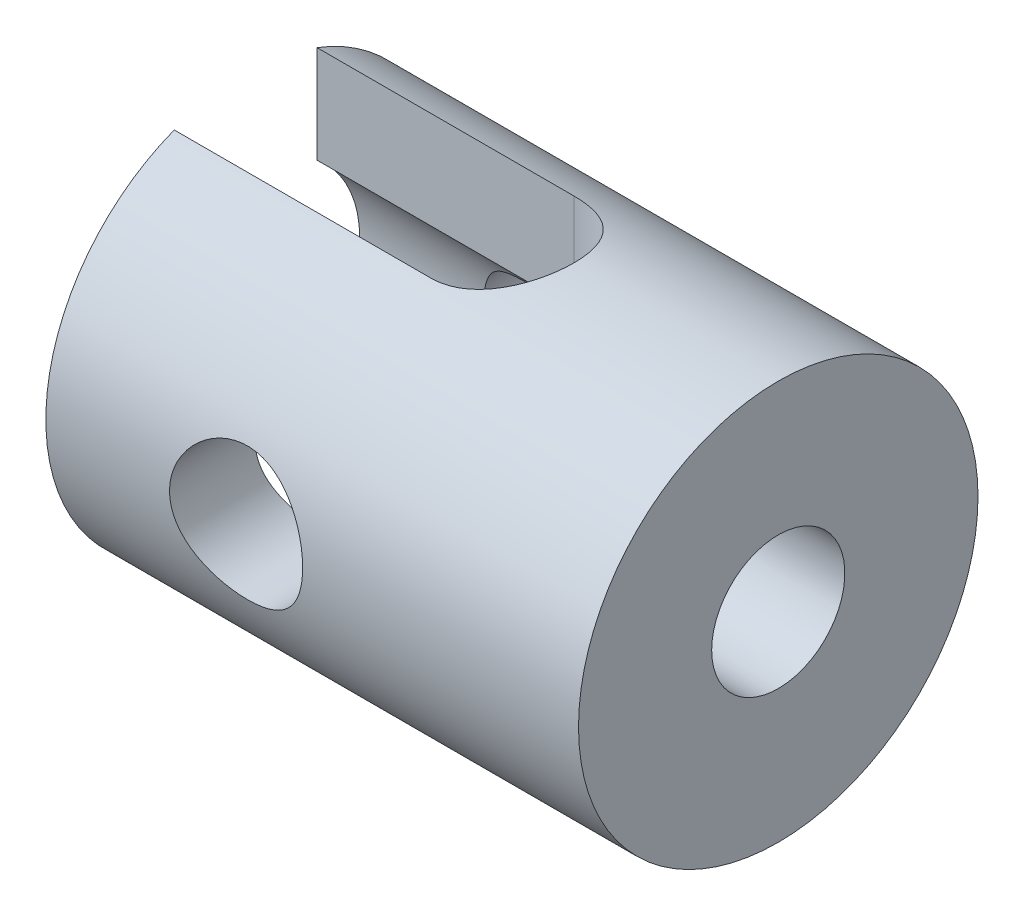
ISO-10303-21;
HEADER;
FILE_DESCRIPTION(('STEP AP214'),'2;1');
FILE_NAME('part.step','',(''),(''),'','','');
FILE_SCHEMA(('AUTOMOTIVE_DESIGN { 1 0 10303 214 1 1 1 1 }'));
ENDSEC;
DATA;
#1=APPLICATION_CONTEXT('core data for automotive mechanical design processes');
#2=APPLICATION_PROTOCOL_DEFINITION('international standard','automotive_design',2000,#1);
#3=PRODUCT_CONTEXT('',#1,'mechanical');
#4=PRODUCT('Part','Part','',(#3));
#5=PRODUCT_RELATED_PRODUCT_CATEGORY('part','',(#4));
#6=PRODUCT_DEFINITION_FORMATION('','',#4);
#7=PRODUCT_DEFINITION_CONTEXT('part definition',#1,'design');
#8=PRODUCT_DEFINITION('design','',#6,#7);
#9=PRODUCT_DEFINITION_SHAPE('','',#8);
#10=(LENGTH_UNIT() NAMED_UNIT(*) SI_UNIT(.MILLI.,.METRE.));
#11=(NAMED_UNIT(*) PLANE_ANGLE_UNIT() SI_UNIT($,.RADIAN.));
#12=(NAMED_UNIT(*) SI_UNIT($,.STERADIAN.) SOLID_ANGLE_UNIT());
#13=UNCERTAINTY_MEASURE_WITH_UNIT(LENGTH_MEASURE(1.E-05),#10,'distance_accuracy_value','');
#14=(GEOMETRIC_REPRESENTATION_CONTEXT(3) GLOBAL_UNCERTAINTY_ASSIGNED_CONTEXT((#13)) GLOBAL_UNIT_ASSIGNED_CONTEXT((#10,
#11,#12)) REPRESENTATION_CONTEXT('',''));
#15=CARTESIAN_POINT('',(0.,0.,0.));
#16=DIRECTION('',(0.,0.,1.));
#17=DIRECTION('',(1.,0.,0.));
#18=AXIS2_PLACEMENT_3D('',#15,#16,#17);
#19=CARTESIAN_POINT('',(-224.,0.,0.));
#20=DIRECTION('',(1.,0.,0.));
#21=DIRECTION('',(0.,0.,-1.));
#22=AXIS2_PLACEMENT_3D('',#19,#20,#21);
#23=CYLINDRICAL_SURFACE('',#22,84.);
#24=CARTESIAN_POINT('',(-172.,0.,-84.));
#25=CARTESIAN_POINT('',(-172.000000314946,-0.763888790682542,-84.0000002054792));
#26=CARTESIAN_POINT('',(-171.968714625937,-1.52777301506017,-83.9895560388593));
#27=CARTESIAN_POINT('',(-171.843875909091,-3.04986150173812,-83.9480670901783));
#28=CARTESIAN_POINT('',(-171.750323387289,-3.80806581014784,-83.9170224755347));
#29=CARTESIAN_POINT('',(-171.501830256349,-5.31331115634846,-83.8351771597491));
#30=CARTESIAN_POINT('',(-171.346884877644,-6.06035132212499,-83.7843749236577));
#31=CARTESIAN_POINT('',(-170.977025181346,-7.53791312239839,-83.6643850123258));
#32=CARTESIAN_POINT('',(-170.762110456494,-8.26843464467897,-83.595197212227));
#33=CARTESIAN_POINT('',(-170.274601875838,-9.70674676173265,-83.4404063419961));
#34=CARTESIAN_POINT('',(-170.002107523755,-10.4145741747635,-83.3548316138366));
#35=CARTESIAN_POINT('',(-169.401440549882,-11.8042296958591,-83.1694151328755));
#36=CARTESIAN_POINT('',(-169.073268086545,-12.4860578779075,-83.0695734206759));
#37=CARTESIAN_POINT('',(-168.363669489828,-13.8196297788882,-82.8581542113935));
#38=CARTESIAN_POINT('',(-167.982235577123,-14.4713690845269,-82.7465750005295));
#39=CARTESIAN_POINT('',(-167.16884321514,-15.740810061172,-82.5145039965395));
#40=CARTESIAN_POINT('',(-166.736883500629,-16.3585108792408,-82.3940119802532));
#41=CARTESIAN_POINT('',(-165.81093074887,-17.5751418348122,-82.1432408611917));
#42=CARTESIAN_POINT('',(-165.315421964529,-18.1728837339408,-82.0127736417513));
#43=CARTESIAN_POINT('',(-164.536669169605,-19.0366917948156,-81.81498490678));
#44=CARTESIAN_POINT('',(-164.271154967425,-19.3191744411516,-81.748703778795));
#45=CARTESIAN_POINT('',(-163.72859641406,-19.8729151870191,-81.6158582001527));
#46=CARTESIAN_POINT('',(-163.451549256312,-20.1441705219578,-81.5492936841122));
#47=CARTESIAN_POINT('',(-162.603807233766,-20.9403760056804,-81.3498616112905));
#48=CARTESIAN_POINT('',(-162.016451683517,-21.4478323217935,-81.2172400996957));
#49=CARTESIAN_POINT('',(-160.80104279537,-22.4126519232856,-80.9563025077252));
#50=CARTESIAN_POINT('',(-160.172989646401,-22.8700154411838,-80.8279864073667));
#51=CARTESIAN_POINT('',(-159.19398774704,-23.5223843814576,-80.6396344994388));
#52=CARTESIAN_POINT('',(-158.856511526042,-23.73697678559,-80.5766886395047));
#53=CARTESIAN_POINT('',(-158.172422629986,-24.1516542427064,-80.4533676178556));
#54=CARTESIAN_POINT('',(-157.825812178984,-24.3517427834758,-80.3929918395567));
#55=CARTESIAN_POINT('',(-156.77290647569,-24.9297766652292,-80.2163870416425));
#56=CARTESIAN_POINT('',(-156.053480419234,-25.2855278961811,-80.1046695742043));
#57=CARTESIAN_POINT('',(-154.585090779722,-25.9345374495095,-79.8969082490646));
#58=CARTESIAN_POINT('',(-153.836134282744,-26.2278106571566,-79.8008606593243));
#59=CARTESIAN_POINT('',(-152.313778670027,-26.7493604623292,-79.6275538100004));
#60=CARTESIAN_POINT('',(-151.540380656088,-26.9776399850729,-79.5502937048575));
#61=CARTESIAN_POINT('',(-150.001417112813,-27.3603802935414,-79.419450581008));
#62=CARTESIAN_POINT('',(-149.236465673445,-27.5170691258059,-79.3651575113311));
#63=CARTESIAN_POINT('',(-147.694928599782,-27.766112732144,-79.2783730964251));
#64=CARTESIAN_POINT('',(-146.918343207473,-27.8584688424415,-79.2458812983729));
#65=CARTESIAN_POINT('',(-145.359756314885,-27.9778801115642,-79.2038019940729));
#66=CARTESIAN_POINT('',(-144.577756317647,-28.0049527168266,-79.1942083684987));
#67=CARTESIAN_POINT('',(-143.014305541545,-27.993561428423,-79.1982359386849));
#68=CARTESIAN_POINT('',(-142.232854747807,-27.95509938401,-79.2118564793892));
#69=CARTESIAN_POINT('',(-140.71229183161,-27.816306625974,-79.2606972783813));
#70=CARTESIAN_POINT('',(-139.972878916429,-27.7188881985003,-79.2949003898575));
#71=CARTESIAN_POINT('',(-138.505340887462,-27.465672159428,-79.3829628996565));
#72=CARTESIAN_POINT('',(-137.777215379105,-27.3098765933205,-79.4368216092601));
#73=CARTESIAN_POINT('',(-136.337086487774,-26.9412744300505,-79.5625891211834));
#74=CARTESIAN_POINT('',(-135.625084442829,-26.7284631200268,-79.634499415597));
#75=CARTESIAN_POINT('',(-134.221847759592,-26.2476270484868,-79.7942742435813));
#76=CARTESIAN_POINT('',(-133.530613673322,-25.9796008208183,-79.8821392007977));
#77=CARTESIAN_POINT('',(-132.162125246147,-25.3856232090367,-80.072897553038));
#78=CARTESIAN_POINT('',(-131.485274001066,-25.0588102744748,-80.1760097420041));
#79=CARTESIAN_POINT('',(-130.49254597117,-24.5293591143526,-80.3389356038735));
#80=CARTESIAN_POINT('',(-130.165379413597,-24.3463269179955,-80.3946233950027));
#81=CARTESIAN_POINT('',(-129.518887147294,-23.967431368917,-80.5083932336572));
#82=CARTESIAN_POINT('',(-129.199563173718,-23.7715652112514,-80.5664758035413));
#83=CARTESIAN_POINT('',(-128.254111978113,-23.1652227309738,-80.743729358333));
#84=CARTESIAN_POINT('',(-127.640456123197,-22.7359760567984,-80.8659143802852));
#85=CARTESIAN_POINT('',(-126.450082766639,-21.8302493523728,-81.115107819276));
#86=CARTESIAN_POINT('',(-125.87336657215,-21.3537676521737,-81.2421164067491));
#87=CARTESIAN_POINT('',(-125.023906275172,-20.5927796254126,-81.4371587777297));
#88=CARTESIAN_POINT('',(-124.736580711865,-20.3242528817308,-81.5046293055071));
#89=CARTESIAN_POINT('',(-124.173556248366,-19.7754055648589,-81.6395320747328));
#90=CARTESIAN_POINT('',(-123.8978546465,-19.4950877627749,-81.7069643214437));
#91=CARTESIAN_POINT('',(-123.08868493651,-18.636925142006,-81.9085474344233));
#92=CARTESIAN_POINT('',(-122.573114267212,-18.0418373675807,-82.0419934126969));
#93=CARTESIAN_POINT('',(-121.593376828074,-16.8096116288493,-82.303303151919));
#94=CARTESIAN_POINT('',(-121.129215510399,-16.172469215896,-82.4311663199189));
#95=CARTESIAN_POINT('',(-120.255529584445,-14.8600622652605,-82.6778340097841));
#96=CARTESIAN_POINT('',(-119.846004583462,-14.1847980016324,-82.7966385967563));
#97=CARTESIAN_POINT('',(-119.080906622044,-12.7935640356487,-83.0230466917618));
#98=CARTESIAN_POINT('',(-118.725913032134,-12.0772552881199,-83.130526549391));
#99=CARTESIAN_POINT('',(-118.077800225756,-10.6150390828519,-83.3298584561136));
#100=CARTESIAN_POINT('',(-117.784681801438,-9.86913124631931,-83.4217103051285));
#101=CARTESIAN_POINT('',(-117.263047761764,-8.35330151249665,-83.5871006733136));
#102=CARTESIAN_POINT('',(-117.03451394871,-7.58338644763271,-83.660644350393));
#103=CARTESIAN_POINT('',(-116.644156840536,-6.0251841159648,-83.7872783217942));
#104=CARTESIAN_POINT('',(-116.482330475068,-5.2368976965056,-83.840369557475));
#105=CARTESIAN_POINT('',(-116.232563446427,-3.68264593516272,-83.9226863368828));
#106=CARTESIAN_POINT('',(-116.141723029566,-2.91719504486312,-83.9528469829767));
#107=CARTESIAN_POINT('',(-116.023462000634,-1.38087862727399,-83.9921635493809));
#108=CARTESIAN_POINT('',(-115.996039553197,-0.610013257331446,-84.0013200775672));
#109=CARTESIAN_POINT('',(-116.0048814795,0.931190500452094,-83.9983729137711));
#110=CARTESIAN_POINT('',(-116.041136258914,1.70152895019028,-83.98627242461));
#111=CARTESIAN_POINT('',(-116.176957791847,3.23597737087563,-83.941155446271));
#112=CARTESIAN_POINT('',(-116.276523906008,4.00008740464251,-83.9081391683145));
#113=CARTESIAN_POINT('',(-116.534204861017,5.49437605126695,-83.8233594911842));
#114=CARTESIAN_POINT('',(-116.690536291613,6.22489577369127,-83.7721680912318));
#115=CARTESIAN_POINT('',(-117.060602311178,7.66974481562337,-83.6522595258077));
#116=CARTESIAN_POINT('',(-117.274335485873,8.3840745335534,-83.5835427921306));
#117=CARTESIAN_POINT('',(-117.757453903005,9.79197192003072,-83.4303229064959));
#118=CARTESIAN_POINT('',(-118.026843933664,10.4855377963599,-83.3458183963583));
#119=CARTESIAN_POINT('',(-118.619148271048,11.8475292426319,-83.1631426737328));
#120=CARTESIAN_POINT('',(-118.942064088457,12.5159541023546,-83.0649710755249));
#121=CARTESIAN_POINT('',(-119.648302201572,13.8409893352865,-82.8546233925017));
#122=CARTESIAN_POINT('',(-120.032989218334,14.4968273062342,-82.7421470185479));
#123=CARTESIAN_POINT('',(-120.648278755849,15.4544883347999,-82.5667263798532));
#124=CARTESIAN_POINT('',(-120.859763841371,15.7693751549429,-82.5071318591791));
#125=CARTESIAN_POINT('',(-121.295216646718,16.3901364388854,-82.3860633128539));
#126=CARTESIAN_POINT('',(-121.519187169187,16.6960088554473,-82.3245888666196));
#127=CARTESIAN_POINT('',(-122.209265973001,17.5993783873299,-82.1379319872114));
#128=CARTESIAN_POINT('',(-122.693563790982,18.182662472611,-82.0105095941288));
#129=CARTESIAN_POINT('',(-123.707519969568,19.3077385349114,-81.7529473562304));
#130=CARTESIAN_POINT('',(-124.237179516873,19.8495294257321,-81.6228074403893));
#131=CARTESIAN_POINT('',(-125.075792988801,20.6405214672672,-81.4251024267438));
#132=CARTESIAN_POINT('',(-125.369487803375,20.9059968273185,-81.357304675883));
#133=CARTESIAN_POINT('',(-125.967875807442,21.4242653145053,-81.2223647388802));
#134=CARTESIAN_POINT('',(-126.272566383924,21.6770614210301,-81.155222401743));
#135=CARTESIAN_POINT('',(-127.202613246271,22.41594598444,-80.9554550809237));
#136=CARTESIAN_POINT('',(-127.843983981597,22.8825677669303,-80.8244804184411));
#137=CARTESIAN_POINT('',(-129.165091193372,23.7603585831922,-80.5708027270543));
#138=CARTESIAN_POINT('',(-129.844829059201,24.1715256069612,-80.4480999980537));
#139=CARTESIAN_POINT('',(-131.238406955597,24.9353763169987,-80.2146280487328));
#140=CARTESIAN_POINT('',(-131.952246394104,25.2880610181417,-80.1038586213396));
#141=CARTESIAN_POINT('',(-133.407820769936,25.9314025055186,-79.8979118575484));
#142=CARTESIAN_POINT('',(-134.149497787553,26.2221805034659,-79.8027041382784));
#143=CARTESIAN_POINT('',(-135.656887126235,26.7399981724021,-79.6306914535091));
#144=CARTESIAN_POINT('',(-136.422599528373,26.9670376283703,-79.5538865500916));
#145=CARTESIAN_POINT('',(-137.972067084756,27.3551024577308,-79.4212847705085));
#146=CARTESIAN_POINT('',(-138.755815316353,27.5161527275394,-79.3654799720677));
#147=CARTESIAN_POINT('',(-140.335478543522,27.7706897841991,-79.2767749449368));
#148=CARTESIAN_POINT('',(-141.13139292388,27.8641799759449,-79.2438735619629));
#149=CARTESIAN_POINT('',(-142.687825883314,27.9795551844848,-79.2032067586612));
#150=CARTESIAN_POINT('',(-143.448060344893,28.0048746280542,-79.1942359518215));
#151=CARTESIAN_POINT('',(-144.967994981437,27.9935797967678,-79.1982294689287));
#152=CARTESIAN_POINT('',(-145.727695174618,27.9569677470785,-79.2111930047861));
#153=CARTESIAN_POINT('',(-147.24087537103,27.8221798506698,-79.258635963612));
#154=CARTESIAN_POINT('',(-147.99435575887,27.7240078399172,-79.2931140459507));
#155=CARTESIAN_POINT('',(-149.489669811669,27.4670535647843,-79.3824881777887));
#156=CARTESIAN_POINT('',(-150.231503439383,27.3082711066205,-79.4373842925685));
#157=CARTESIAN_POINT('',(-151.684327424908,26.935160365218,-79.5646602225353));
#158=CARTESIAN_POINT('',(-152.395636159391,26.7219484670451,-79.6366868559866));
#159=CARTESIAN_POINT('',(-153.797466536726,26.2404062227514,-79.7966502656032));
#160=CARTESIAN_POINT('',(-154.487988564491,25.9720768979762,-79.8845867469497));
#161=CARTESIAN_POINT('',(-155.844183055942,25.3823202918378,-80.0739262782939));
#162=CARTESIAN_POINT('',(-156.509851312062,25.0608840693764,-80.1753315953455));
#163=CARTESIAN_POINT('',(-157.81237177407,24.3672513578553,-80.3888593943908));
#164=CARTESIAN_POINT('',(-158.449222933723,23.995053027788,-80.5009822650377));
#165=CARTESIAN_POINT('',(-159.717768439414,23.1849602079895,-80.7381155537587));
#166=CARTESIAN_POINT('',(-160.348024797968,22.7449075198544,-80.863474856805));
#167=CARTESIAN_POINT('',(-161.264042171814,22.0476805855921,-81.0552767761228));
#168=CARTESIAN_POINT('',(-161.564502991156,21.8090656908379,-81.1198416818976));
#169=CARTESIAN_POINT('',(-162.155336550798,21.319730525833,-81.2498196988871));
#170=CARTESIAN_POINT('',(-162.445706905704,21.0690074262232,-81.3152330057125));
#171=CARTESIAN_POINT('',(-163.300971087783,20.2992807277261,-81.5120827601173));
#172=CARTESIAN_POINT('',(-163.850056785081,19.7626902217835,-81.6441372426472));
#173=CARTESIAN_POINT('',(-164.902529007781,18.6459904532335,-81.9063847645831));
#174=CARTESIAN_POINT('',(-165.405915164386,18.0658808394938,-82.0365777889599));
#175=CARTESIAN_POINT('',(-166.133669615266,17.1540056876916,-82.2304190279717));
#176=CARTESIAN_POINT('',(-166.37592522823,16.8367845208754,-82.2959948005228));
#177=CARTESIAN_POINT('',(-166.846770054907,16.1921093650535,-82.4252611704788));
#178=CARTESIAN_POINT('',(-167.075362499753,15.8646578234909,-82.4889522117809));
#179=CARTESIAN_POINT('',(-167.740145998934,14.8675313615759,-82.6765602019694));
#180=CARTESIAN_POINT('',(-168.155379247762,14.1830394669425,-82.7970217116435));
#181=CARTESIAN_POINT('',(-168.926354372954,12.7795906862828,-83.0252221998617));
#182=CARTESIAN_POINT('',(-169.282108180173,12.0606407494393,-83.1329637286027));
#183=CARTESIAN_POINT('',(-169.931294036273,10.5929998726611,-83.3326860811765));
#184=CARTESIAN_POINT('',(-170.224729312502,9.84431047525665,-83.4246677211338));
#185=CARTESIAN_POINT('',(-170.734939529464,8.35664447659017,-83.5864887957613));
#186=CARTESIAN_POINT('',(-170.95455357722,7.61872818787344,-83.6571338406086));
#187=CARTESIAN_POINT('',(-171.332524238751,6.12584100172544,-83.7796805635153));
#188=CARTESIAN_POINT('',(-171.490882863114,5.37087066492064,-83.8315828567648));
#189=CARTESIAN_POINT('',(-171.744834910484,3.84951338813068,-83.9152040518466));
#190=CARTESIAN_POINT('',(-171.840442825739,3.08312912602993,-83.9469276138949));
#191=CARTESIAN_POINT('',(-171.968025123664,1.54449500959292,-83.9893254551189));
#192=CARTESIAN_POINT('',(-171.999999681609,0.772245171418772,-83.999999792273));
#193=CARTESIAN_POINT('',(-172.,0.,-84.));
#194=B_SPLINE_CURVE_WITH_KNOTS('',3,(#24,#25,#26,#27,#28,#29,#30,#31,#32,#33,#34,#35,#36,#37,
#38,#39,#40,#41,#42,#43,#44,#45,#46,#47,#48,#49,#50,#51,#52,#53,#54,#55,#56,#57,#58,#59,#60,#61,
#62,#63,#64,#65,#66,#67,#68,#69,#70,#71,#72,#73,#74,#75,#76,#77,#78,#79,#80,#81,#82,#83,#84,#85,
#86,#87,#88,#89,#90,#91,#92,#93,#94,#95,#96,#97,#98,#99,#100,#101,#102,#103,#104,#105,#106,#107,
#108,#109,#110,#111,#112,#113,#114,#115,#116,#117,#118,#119,#120,#121,#122,#123,#124,#125,#126,
#127,#128,#129,#130,#131,#132,#133,#134,#135,#136,#137,#138,#139,#140,#141,#142,#143,#144,#145,
#146,#147,#148,#149,#150,#151,#152,#153,#154,#155,#156,#157,#158,#159,#160,#161,#162,#163,#164,
#165,#166,#167,#168,#169,#170,#171,#172,#173,#174,#175,#176,#177,#178,#179,#180,#181,#182,#183,
#184,#185,#186,#187,#188,#189,#190,#191,#192,#193),.UNSPECIFIED.,.T.,.F.,(4,2,2,2,2,2,2,2,2,2,2,
2,2,2,2,2,2,2,2,2,2,2,2,2,2,2,2,2,2,2,2,2,2,2,2,2,2,2,2,2,2,2,2,2,2,2,2,2,2,2,2,2,2,2,2,2,2,2,2,
2,2,2,2,2,2,2,2,2,2,2,2,2,2,2,2,2,2,2,2,2,2,2,2,2,4),(0.,2.29095000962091,4.58188140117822,
6.87299080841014,9.16411577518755,11.4513133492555,13.7385044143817,16.0260298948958,
18.3136126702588,20.672619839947,21.8522483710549,23.0321656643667,25.3917277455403,
27.7512788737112,28.9654938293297,30.1794158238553,32.6070543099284,35.0341137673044,
37.4610639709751,39.8062421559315,42.1513716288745,44.4958743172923,46.8403108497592,
49.0774431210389,51.3144970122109,53.5517358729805,55.7890341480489,58.0622817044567,
59.1990159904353,60.3359995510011,62.6097975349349,64.883675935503,66.080420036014,
67.2768844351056,69.669659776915,72.0626886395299,74.455700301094,76.8725996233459,
79.2895298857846,81.7057784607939,84.1219158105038,86.4332766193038,88.7445705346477,
91.0555162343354,93.3664385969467,95.6102809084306,97.8540679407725,100.09804808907,
102.342091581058,104.645121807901,105.79675748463,106.948652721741,109.252318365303,
111.556044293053,112.760708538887,113.965088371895,116.37368400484,118.782366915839,
121.191008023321,123.594888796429,125.998777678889,128.401758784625,130.804618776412,
133.083936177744,135.363171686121,137.642265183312,139.921365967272,142.157027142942,
144.392646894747,146.628643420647,148.864721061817,151.198384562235,152.365348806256,
153.532587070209,155.866915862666,158.201263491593,159.414426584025,160.627301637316,
163.052876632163,165.477964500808,167.902926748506,170.219555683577,172.53610857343,
174.852126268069,177.168137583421),.UNSPECIFIED.);
#195=CARTESIAN_POINT('',(-172.,0.,-84.));
#196=VERTEX_POINT('',#195);
#197=EDGE_CURVE('E107',#196,#196,#194,.T.);
#198=ORIENTED_EDGE('',*,*,#197,.T.);
#199=EDGE_LOOP('',(#198));
#200=FACE_BOUND('',#199,.T.);
#201=CARTESIAN_POINT('',(0.,0.,0.));
#202=DIRECTION('',(1.,0.,0.));
#203=DIRECTION('',(0.,0.,-1.));
#204=AXIS2_PLACEMENT_3D('',#201,#202,#203);
#205=CIRCLE('',#204,84.);
#206=CARTESIAN_POINT('',(0.,0.,-84.));
#207=VERTEX_POINT('',#206);
#208=EDGE_CURVE('E124',#207,#207,#205,.T.);
#209=ORIENTED_EDGE('',*,*,#208,.F.);
#210=EDGE_LOOP('',(#209));
#211=FACE_BOUND('',#210,.T.);
#212=DIRECTION('',(1.,0.,0.));
#213=VECTOR('',#212,1.);
#214=CARTESIAN_POINT('',(-224.,-78.4601809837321,-30.));
#215=LINE('',#214,#213);
#216=CARTESIAN_POINT('',(-224.,-78.4601809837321,-30.));
#217=VERTEX_POINT('',#216);
#218=CARTESIAN_POINT('',(-116.,-78.4601809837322,-30.));
#219=VERTEX_POINT('',#218);
#220=EDGE_CURVE('E228',#217,#219,#215,.T.);
#221=ORIENTED_EDGE('',*,*,#220,.F.);
#222=CARTESIAN_POINT('',(-224.,0.,0.));
#223=DIRECTION('',(1.,0.,0.));
#224=DIRECTION('',(0.,0.,-1.));
#225=AXIS2_PLACEMENT_3D('',#222,#223,#224);
#226=CIRCLE('',#225,84.);
#227=CARTESIAN_POINT('',(-224.,78.4601809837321,-30.));
#228=VERTEX_POINT('',#227);
#229=EDGE_CURVE('E220',#217,#228,#226,.T.);
#230=ORIENTED_EDGE('',*,*,#229,.T.);
#231=DIRECTION('',(1.,0.,0.));
#232=VECTOR('',#231,1.);
#233=CARTESIAN_POINT('',(-224.,78.4601809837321,-30.));
#234=LINE('',#233,#232);
#235=CARTESIAN_POINT('',(-116.,78.4601809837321,-30.));
#236=VERTEX_POINT('',#235);
#237=EDGE_CURVE('E225',#236,#228,#234,.F.);
#238=ORIENTED_EDGE('',*,*,#237,.F.);
#239=CARTESIAN_POINT('',(-116.,78.4601809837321,30.));
#240=CARTESIAN_POINT('',(-115.592680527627,78.4601719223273,30.0000071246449));
#241=CARTESIAN_POINT('',(-115.185366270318,78.4633526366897,29.9917046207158));
#242=CARTESIAN_POINT('',(-114.371518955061,78.4760267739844,29.9585346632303));
#243=CARTESIAN_POINT('',(-113.96498588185,78.4855200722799,29.9336675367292));
#244=CARTESIAN_POINT('',(-113.153577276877,78.5107487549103,29.8674325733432));
#245=CARTESIAN_POINT('',(-112.748701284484,78.5264822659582,29.8260696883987));
#246=CARTESIAN_POINT('',(-111.941272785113,78.5640536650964,29.7269614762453));
#247=CARTESIAN_POINT('',(-111.538720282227,78.5858915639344,29.6692161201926));
#248=CARTESIAN_POINT('',(-110.338285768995,78.6601507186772,29.4720343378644));
#249=CARTESIAN_POINT('',(-109.544765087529,78.7214084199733,29.3084173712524));
#250=CARTESIAN_POINT('',(-107.975492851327,78.8655927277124,28.9181836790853));
#251=CARTESIAN_POINT('',(-107.19974208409,78.9485202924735,28.6915641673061));
#252=CARTESIAN_POINT('',(-105.671669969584,79.1334295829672,28.1775585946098));
#253=CARTESIAN_POINT('',(-104.919330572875,79.2353961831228,27.8902207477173));
#254=CARTESIAN_POINT('',(-103.442167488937,79.4554314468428,27.2570477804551));
#255=CARTESIAN_POINT('',(-102.717343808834,79.5735001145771,26.9112126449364));
#256=CARTESIAN_POINT('',(-101.29896768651,79.8225061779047,26.1633874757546));
#257=CARTESIAN_POINT('',(-100.605436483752,79.9534521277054,25.761360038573));
#258=CARTESIAN_POINT('',(-99.2540174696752,80.2246197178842,24.9040650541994));
#259=CARTESIAN_POINT('',(-98.5961306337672,80.3648416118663,24.448796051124));
#260=CARTESIAN_POINT('',(-97.2935887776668,80.6567461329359,23.468306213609));
#261=CARTESIAN_POINT('',(-96.6505600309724,80.808662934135,22.9409934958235));
#262=CARTESIAN_POINT('',(-95.4107137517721,81.1144726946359,21.8350955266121));
#263=CARTESIAN_POINT('',(-94.8138973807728,81.2683657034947,21.2565089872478));
#264=CARTESIAN_POINT('',(-93.6699518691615,81.5740592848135,20.0514154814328));
#265=CARTESIAN_POINT('',(-93.1228315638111,81.7258594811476,19.4249000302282));
#266=CARTESIAN_POINT('',(-92.0818501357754,82.0233445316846,18.1277055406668));
#267=CARTESIAN_POINT('',(-91.5879895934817,82.169029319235,17.4570260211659));
#268=CARTESIAN_POINT('',(-90.6426448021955,82.454752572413,16.0543286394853));
#269=CARTESIAN_POINT('',(-90.1929163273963,82.5944825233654,15.3210627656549));
#270=CARTESIAN_POINT('',(-89.3571156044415,82.8594359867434,13.8165563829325));
#271=CARTESIAN_POINT('',(-88.9710450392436,82.9846591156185,13.0453148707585));
#272=CARTESIAN_POINT('',(-88.2659910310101,83.2169720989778,11.4703491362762));
#273=CARTESIAN_POINT('',(-87.9469893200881,83.3240668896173,10.6666338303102));
#274=CARTESIAN_POINT('',(-87.3789508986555,83.5170223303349,9.03237497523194));
#275=CARTESIAN_POINT('',(-87.1299107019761,83.602884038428,8.20183276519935));
#276=CARTESIAN_POINT('',(-86.7127071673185,83.7478883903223,6.55350771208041));
#277=CARTESIAN_POINT('',(-86.5417395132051,83.8079518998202,5.73651521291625));
#278=CARTESIAN_POINT('',(-86.2683591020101,83.9044341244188,4.08975437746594));
#279=CARTESIAN_POINT('',(-86.1659447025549,83.9408534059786,3.25998634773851));
#280=CARTESIAN_POINT('',(-86.0307433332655,83.9890013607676,1.59427756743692));
#281=CARTESIAN_POINT('',(-85.997940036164,84.0007358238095,0.758338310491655));
#282=CARTESIAN_POINT('',(-86.002260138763,83.9991926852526,-0.913325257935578));
#283=CARTESIAN_POINT('',(-86.0393816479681,83.9859157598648,-1.74904957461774));
#284=CARTESIAN_POINT('',(-86.1799107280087,83.9358904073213,-3.37622130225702));
#285=CARTESIAN_POINT('',(-86.2802595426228,83.9002253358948,-4.1679685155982));
#286=CARTESIAN_POINT('',(-86.5434099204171,83.8073716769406,-5.73970044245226));
#287=CARTESIAN_POINT('',(-86.7062092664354,83.7501838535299,-6.51968557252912));
#288=CARTESIAN_POINT('',(-87.0927919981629,83.6157513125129,-8.06262378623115));
#289=CARTESIAN_POINT('',(-87.3165768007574,83.5385061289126,-8.82557647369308));
#290=CARTESIAN_POINT('',(-87.8232159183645,83.3659071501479,-10.3294966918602));
#291=CARTESIAN_POINT('',(-88.1060716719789,83.2705529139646,-11.0704636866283));
#292=CARTESIAN_POINT('',(-88.7329487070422,83.0626477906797,-12.5360280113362));
#293=CARTESIAN_POINT('',(-89.0777704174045,82.9498749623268,-13.2602512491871));
#294=CARTESIAN_POINT('',(-89.8232022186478,82.7109432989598,-14.6770588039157));
#295=CARTESIAN_POINT('',(-90.2238125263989,82.5847844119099,-15.3696429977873));
#296=CARTESIAN_POINT('',(-91.0781340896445,82.3221366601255,-16.7194109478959));
#297=CARTESIAN_POINT('',(-91.5318584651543,82.1856452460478,-17.3765858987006));
#298=CARTESIAN_POINT('',(-92.4894212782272,81.9056634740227,-18.6517696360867));
#299=CARTESIAN_POINT('',(-92.9932614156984,81.76217287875,-19.2697770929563));
#300=CARTESIAN_POINT('',(-94.0762814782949,81.4638827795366,-20.4952305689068));
#301=CARTESIAN_POINT('',(-94.6580495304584,81.3088888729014,-21.1003442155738));
#302=CARTESIAN_POINT('',(-95.8702700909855,80.9991524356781,-22.2597725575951));
#303=CARTESIAN_POINT('',(-96.5007246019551,80.8444099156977,-22.8140851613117));
#304=CARTESIAN_POINT('',(-97.8067747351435,80.5393705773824,-23.8686246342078));
#305=CARTESIAN_POINT('',(-98.4823869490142,80.389075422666,-24.3688314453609));
#306=CARTESIAN_POINT('',(-99.8745068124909,80.0972436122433,-25.3115610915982));
#307=CARTESIAN_POINT('',(-100.591013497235,79.9557067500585,-25.7540852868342));
#308=CARTESIAN_POINT('',(-102.074584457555,79.6829695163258,-26.5860820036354));
#309=CARTESIAN_POINT('',(-102.842351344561,79.5520170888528,-26.9743847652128));
#310=CARTESIAN_POINT('',(-104.410874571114,79.3076783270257,-27.6845319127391));
#311=CARTESIAN_POINT('',(-105.211634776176,79.1942940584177,-28.0063684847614));
#312=CARTESIAN_POINT('',(-106.839214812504,78.9890445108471,-28.580126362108));
#313=CARTESIAN_POINT('',(-107.665996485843,78.8971492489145,-28.8321451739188));
#314=CARTESIAN_POINT('',(-109.340250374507,78.7379123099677,-29.2642175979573));
#315=CARTESIAN_POINT('',(-110.18771302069,78.6705594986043,-29.4443038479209));
#316=CARTESIAN_POINT('',(-111.451106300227,78.5908721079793,-29.6560266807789));
#317=CARTESIAN_POINT('',(-111.861819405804,78.568155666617,-29.7161219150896));
#318=CARTESIAN_POINT('',(-112.685606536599,78.5290781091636,-29.8192385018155));
#319=CARTESIAN_POINT('',(-113.098679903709,78.5127153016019,-29.8622643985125));
#320=CARTESIAN_POINT('',(-113.925995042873,78.486500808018,-29.931097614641));
#321=CARTESIAN_POINT('',(-114.340235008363,78.4766419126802,-29.9569239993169));
#322=CARTESIAN_POINT('',(-115.169647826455,78.4634762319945,-29.9913813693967));
#323=CARTESIAN_POINT('',(-115.584820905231,78.460171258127,-30.0000076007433));
#324=CARTESIAN_POINT('',(-116.,78.4601809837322,-30.));
#325=B_SPLINE_CURVE_WITH_KNOTS('',3,(#239,#240,#241,#242,#243,#244,#245,#246,#247,#248,#249,
#250,#251,#252,#253,#254,#255,#256,#257,#258,#259,#260,#261,#262,#263,#264,#265,#266,#267,#268,
#269,#270,#271,#272,#273,#274,#275,#276,#277,#278,#279,#280,#281,#282,#283,#284,#285,#286,#287,
#288,#289,#290,#291,#292,#293,#294,#295,#296,#297,#298,#299,#300,#301,#302,#303,#304,#305,#306,
#307,#308,#309,#310,#311,#312,#313,#314,#315,#316,#317,#318,#319,#320,#321,#322,#323,#324),
.UNSPECIFIED.,.F.,.F.,(4,2,2,2,2,2,2,2,2,2,2,2,2,2,2,2,2,2,2,2,2,2,2,2,2,2,2,2,2,2,2,2,2,2,2,2,
2,2,2,2,2,2,4),(0.,1.22185175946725,2.44367939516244,3.66514052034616,4.8866037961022,
7.32094092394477,9.75538572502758,12.1879046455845,14.6204241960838,17.0545706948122,
19.4887837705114,22.0219947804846,24.5552694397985,27.0889936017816,29.6227453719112,
32.2339122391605,34.845148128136,37.4556718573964,40.0660654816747,42.5734233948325,
45.0807212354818,47.5874309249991,50.0940728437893,52.4878902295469,54.8816226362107,
57.2754106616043,59.6692569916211,62.0965969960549,64.5239464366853,66.9518967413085,
69.3799294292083,71.9378125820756,74.4958010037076,77.0547344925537,79.6136076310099,
82.2211735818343,84.8290459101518,87.4332575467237,90.0362862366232,91.2830816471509,
92.5295449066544,93.7746241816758,95.020047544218),.UNSPECIFIED.);
#326=CARTESIAN_POINT('',(-116.,78.460180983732,30.));
#327=VERTEX_POINT('',#326);
#328=EDGE_CURVE('E128',#327,#236,#325,.T.);
#329=ORIENTED_EDGE('',*,*,#328,.F.);
#330=DIRECTION('',(1.,0.,0.));
#331=VECTOR('',#330,1.);
#332=CARTESIAN_POINT('',(-224.,78.4601809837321,30.));
#333=LINE('',#332,#331);
#334=CARTESIAN_POINT('',(-224.,78.4601809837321,30.));
#335=VERTEX_POINT('',#334);
#336=EDGE_CURVE('E232',#335,#327,#333,.T.);
#337=ORIENTED_EDGE('',*,*,#336,.F.);
#338=CARTESIAN_POINT('',(-224.,-78.4601809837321,30.));
#339=VERTEX_POINT('',#338);
#340=EDGE_CURVE('E118',#335,#339,#226,.T.);
#341=ORIENTED_EDGE('',*,*,#340,.T.);
#342=DIRECTION('',(1.,0.,0.));
#343=VECTOR('',#342,1.);
#344=CARTESIAN_POINT('',(-224.,-78.4601809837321,30.));
#345=LINE('',#344,#343);
#346=CARTESIAN_POINT('',(-116.,-78.4601809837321,30.));
#347=VERTEX_POINT('',#346);
#348=EDGE_CURVE('E230',#347,#339,#345,.F.);
#349=ORIENTED_EDGE('',*,*,#348,.F.);
#350=CARTESIAN_POINT('',(-116.,-78.4601809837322,-30.));
#351=CARTESIAN_POINT('',(-115.592680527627,-78.4601719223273,-30.0000071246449));
#352=CARTESIAN_POINT('',(-115.185366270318,-78.4633526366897,-29.9917046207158));
#353=CARTESIAN_POINT('',(-114.371518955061,-78.4760267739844,-29.9585346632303));
#354=CARTESIAN_POINT('',(-113.96498588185,-78.4855200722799,-29.9336675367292));
#355=CARTESIAN_POINT('',(-113.153577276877,-78.5107487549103,-29.8674325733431));
#356=CARTESIAN_POINT('',(-112.748701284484,-78.5264822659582,-29.8260696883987));
#357=CARTESIAN_POINT('',(-111.941272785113,-78.5640536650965,-29.7269614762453));
#358=CARTESIAN_POINT('',(-111.538720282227,-78.5858915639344,-29.6692161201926));
#359=CARTESIAN_POINT('',(-110.338285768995,-78.6601507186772,-29.4720343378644));
#360=CARTESIAN_POINT('',(-109.544765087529,-78.7214084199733,-29.3084173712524));
#361=CARTESIAN_POINT('',(-107.975492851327,-78.8655927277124,-28.9181836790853));
#362=CARTESIAN_POINT('',(-107.19974208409,-78.9485202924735,-28.691564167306));
#363=CARTESIAN_POINT('',(-105.671669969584,-79.1334295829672,-28.1775585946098));
#364=CARTESIAN_POINT('',(-104.919330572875,-79.2353961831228,-27.8902207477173));
#365=CARTESIAN_POINT('',(-103.442167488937,-79.4554314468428,-27.257047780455));
#366=CARTESIAN_POINT('',(-102.717343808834,-79.5735001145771,-26.9112126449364));
#367=CARTESIAN_POINT('',(-101.29896768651,-79.8225061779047,-26.1633874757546));
#368=CARTESIAN_POINT('',(-100.605436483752,-79.9534521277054,-25.761360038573));
#369=CARTESIAN_POINT('',(-99.2540174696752,-80.2246197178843,-24.9040650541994));
#370=CARTESIAN_POINT('',(-98.5961306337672,-80.3648416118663,-24.4487960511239));
#371=CARTESIAN_POINT('',(-97.2935887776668,-80.6567461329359,-23.468306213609));
#372=CARTESIAN_POINT('',(-96.6505600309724,-80.808662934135,-22.9409934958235));
#373=CARTESIAN_POINT('',(-95.4107137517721,-81.1144726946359,-21.835095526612));
#374=CARTESIAN_POINT('',(-94.8138973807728,-81.2683657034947,-21.2565089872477));
#375=CARTESIAN_POINT('',(-93.6699518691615,-81.5740592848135,-20.0514154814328));
#376=CARTESIAN_POINT('',(-93.1228315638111,-81.7258594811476,-19.4249000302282));
#377=CARTESIAN_POINT('',(-92.0818501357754,-82.0233445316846,-18.1277055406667));
#378=CARTESIAN_POINT('',(-91.5879895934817,-82.169029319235,-17.4570260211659));
#379=CARTESIAN_POINT('',(-90.6426448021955,-82.4547525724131,-16.0543286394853));
#380=CARTESIAN_POINT('',(-90.1929163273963,-82.5944825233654,-15.3210627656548));
#381=CARTESIAN_POINT('',(-89.3571156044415,-82.8594359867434,-13.8165563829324));
#382=CARTESIAN_POINT('',(-88.9710450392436,-82.9846591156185,-13.0453148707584));
#383=CARTESIAN_POINT('',(-88.2659910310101,-83.2169720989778,-11.4703491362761));
#384=CARTESIAN_POINT('',(-87.9469893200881,-83.3240668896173,-10.6666338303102));
#385=CARTESIAN_POINT('',(-87.3789508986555,-83.5170223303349,-9.03237497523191));
#386=CARTESIAN_POINT('',(-87.1299107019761,-83.602884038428,-8.20183276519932));
#387=CARTESIAN_POINT('',(-86.7127071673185,-83.7478883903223,-6.55350771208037));
#388=CARTESIAN_POINT('',(-86.5417395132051,-83.8079518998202,-5.73651521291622));
#389=CARTESIAN_POINT('',(-86.2683591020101,-83.9044341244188,-4.08975437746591));
#390=CARTESIAN_POINT('',(-86.1659447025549,-83.9408534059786,-3.25998634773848));
#391=CARTESIAN_POINT('',(-86.0307433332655,-83.9890013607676,-1.59427756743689));
#392=CARTESIAN_POINT('',(-85.997940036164,-84.0007358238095,-0.758338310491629));
#393=CARTESIAN_POINT('',(-86.002260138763,-83.9991926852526,0.913325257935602));
#394=CARTESIAN_POINT('',(-86.0393816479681,-83.9859157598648,1.74904957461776));
#395=CARTESIAN_POINT('',(-86.1799107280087,-83.9358904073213,3.37622130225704));
#396=CARTESIAN_POINT('',(-86.2802595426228,-83.9002253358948,4.16796851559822));
#397=CARTESIAN_POINT('',(-86.5434099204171,-83.8073716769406,5.73970044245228));
#398=CARTESIAN_POINT('',(-86.7062092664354,-83.7501838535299,6.51968557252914));
#399=CARTESIAN_POINT('',(-87.0927919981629,-83.6157513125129,8.06262378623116));
#400=CARTESIAN_POINT('',(-87.3165768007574,-83.5385061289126,8.8255764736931));
#401=CARTESIAN_POINT('',(-87.8232159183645,-83.3659071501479,10.3294966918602));
#402=CARTESIAN_POINT('',(-88.1060716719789,-83.2705529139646,11.0704636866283));
#403=CARTESIAN_POINT('',(-88.7329487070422,-83.0626477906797,12.5360280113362));
#404=CARTESIAN_POINT('',(-89.0777704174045,-82.9498749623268,13.2602512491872));
#405=CARTESIAN_POINT('',(-89.8232022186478,-82.7109432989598,14.6770588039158));
#406=CARTESIAN_POINT('',(-90.2238125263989,-82.5847844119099,15.3696429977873));
#407=CARTESIAN_POINT('',(-91.0781340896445,-82.3221366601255,16.719410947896));
#408=CARTESIAN_POINT('',(-91.5318584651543,-82.1856452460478,17.3765858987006));
#409=CARTESIAN_POINT('',(-92.4894212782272,-81.9056634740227,18.6517696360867));
#410=CARTESIAN_POINT('',(-92.9932614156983,-81.76217287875,19.2697770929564));
#411=CARTESIAN_POINT('',(-94.0762814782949,-81.4638827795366,20.4952305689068));
#412=CARTESIAN_POINT('',(-94.6580495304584,-81.3088888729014,21.1003442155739));
#413=CARTESIAN_POINT('',(-95.8702700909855,-80.9991524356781,22.2597725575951));
#414=CARTESIAN_POINT('',(-96.5007246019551,-80.8444099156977,22.8140851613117));
#415=CARTESIAN_POINT('',(-97.8067747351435,-80.5393705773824,23.8686246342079));
#416=CARTESIAN_POINT('',(-98.4823869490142,-80.389075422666,24.368831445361));
#417=CARTESIAN_POINT('',(-99.8745068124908,-80.0972436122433,25.3115610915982));
#418=CARTESIAN_POINT('',(-100.591013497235,-79.9557067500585,25.7540852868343));
#419=CARTESIAN_POINT('',(-102.074584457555,-79.6829695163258,26.5860820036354));
#420=CARTESIAN_POINT('',(-102.842351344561,-79.5520170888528,26.9743847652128));
#421=CARTESIAN_POINT('',(-104.410874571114,-79.3076783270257,27.6845319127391));
#422=CARTESIAN_POINT('',(-105.211634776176,-79.1942940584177,28.0063684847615));
#423=CARTESIAN_POINT('',(-106.839214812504,-78.9890445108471,28.580126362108));
#424=CARTESIAN_POINT('',(-107.665996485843,-78.8971492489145,28.8321451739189));
#425=CARTESIAN_POINT('',(-109.340250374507,-78.7379123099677,29.2642175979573));
#426=CARTESIAN_POINT('',(-110.18771302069,-78.6705594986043,29.444303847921));
#427=CARTESIAN_POINT('',(-111.451106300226,-78.5908721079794,29.6560266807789));
#428=CARTESIAN_POINT('',(-111.861819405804,-78.568155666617,29.7161219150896));
#429=CARTESIAN_POINT('',(-112.685606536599,-78.5290781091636,29.8192385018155));
#430=CARTESIAN_POINT('',(-113.098679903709,-78.5127153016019,29.8622643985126));
#431=CARTESIAN_POINT('',(-113.925995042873,-78.4865008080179,29.9310976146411));
#432=CARTESIAN_POINT('',(-114.340235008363,-78.4766419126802,29.956923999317));
#433=CARTESIAN_POINT('',(-115.169647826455,-78.4634762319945,29.9913813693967));
#434=CARTESIAN_POINT('',(-115.584820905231,-78.460171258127,30.0000076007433));
#435=CARTESIAN_POINT('',(-116.,-78.4601809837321,30.));
#436=B_SPLINE_CURVE_WITH_KNOTS('',3,(#350,#351,#352,#353,#354,#355,#356,#357,#358,#359,#360,
#361,#362,#363,#364,#365,#366,#367,#368,#369,#370,#371,#372,#373,#374,#375,#376,#377,#378,#379,
#380,#381,#382,#383,#384,#385,#386,#387,#388,#389,#390,#391,#392,#393,#394,#395,#396,#397,#398,
#399,#400,#401,#402,#403,#404,#405,#406,#407,#408,#409,#410,#411,#412,#413,#414,#415,#416,#417,
#418,#419,#420,#421,#422,#423,#424,#425,#426,#427,#428,#429,#430,#431,#432,#433,#434,#435),
.UNSPECIFIED.,.F.,.F.,(4,2,2,2,2,2,2,2,2,2,2,2,2,2,2,2,2,2,2,2,2,2,2,2,2,2,2,2,2,2,2,2,2,2,2,2,
2,2,2,2,2,2,4),(0.,1.22185175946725,2.44367939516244,3.66514052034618,4.88660379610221,
7.32094092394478,9.75538572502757,12.1879046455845,14.6204241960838,17.0545706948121,
19.4887837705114,22.0219947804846,24.5552694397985,27.0889936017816,29.6227453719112,
32.2339122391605,34.8451481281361,37.4556718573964,40.0660654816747,42.5734233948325,
45.0807212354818,47.5874309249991,50.0940728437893,52.4878902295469,54.8816226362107,
57.2754106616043,59.6692569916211,62.0965969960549,64.5239464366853,66.9518967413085,
69.3799294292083,71.9378125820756,74.4958010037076,77.0547344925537,79.6136076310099,
82.2211735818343,84.8290459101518,87.4332575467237,90.0362862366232,91.283081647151,
92.5295449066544,93.7746241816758,95.020047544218),.UNSPECIFIED.);
#437=EDGE_CURVE('E135',#219,#347,#436,.T.);
#438=ORIENTED_EDGE('',*,*,#437,.F.);
#439=EDGE_LOOP('',(#221,#230,#238,#329,#337,#341,#349,#438));
#440=FACE_BOUND('',#439,.T.);
#441=CARTESIAN_POINT('',(-172.,0.,84.));
#442=CARTESIAN_POINT('',(-172.000000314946,0.763888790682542,84.0000002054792));
#443=CARTESIAN_POINT('',(-171.968714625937,1.52777301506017,83.9895560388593));
#444=CARTESIAN_POINT('',(-171.843875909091,3.04986150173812,83.9480670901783));
#445=CARTESIAN_POINT('',(-171.750323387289,3.80806581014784,83.9170224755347));
#446=CARTESIAN_POINT('',(-171.501830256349,5.31331115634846,83.8351771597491));
#447=CARTESIAN_POINT('',(-171.346884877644,6.06035132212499,83.7843749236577));
#448=CARTESIAN_POINT('',(-170.977025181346,7.53791312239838,83.6643850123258));
#449=CARTESIAN_POINT('',(-170.762110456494,8.26843464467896,83.595197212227));
#450=CARTESIAN_POINT('',(-170.274601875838,9.70674676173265,83.4404063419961));
#451=CARTESIAN_POINT('',(-170.002107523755,10.4145741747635,83.3548316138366));
#452=CARTESIAN_POINT('',(-169.401440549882,11.8042296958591,83.1694151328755));
#453=CARTESIAN_POINT('',(-169.073268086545,12.4860578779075,83.0695734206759));
#454=CARTESIAN_POINT('',(-168.363669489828,13.8196297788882,82.8581542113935));
#455=CARTESIAN_POINT('',(-167.982235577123,14.4713690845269,82.7465750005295));
#456=CARTESIAN_POINT('',(-167.16884321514,15.740810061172,82.5145039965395));
#457=CARTESIAN_POINT('',(-166.736883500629,16.3585108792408,82.3940119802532));
#458=CARTESIAN_POINT('',(-165.81093074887,17.5751418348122,82.1432408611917));
#459=CARTESIAN_POINT('',(-165.315421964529,18.1728837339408,82.0127736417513));
#460=CARTESIAN_POINT('',(-164.536669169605,19.0366917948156,81.81498490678));
#461=CARTESIAN_POINT('',(-164.271154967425,19.3191744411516,81.748703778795));
#462=CARTESIAN_POINT('',(-163.72859641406,19.8729151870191,81.6158582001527));
#463=CARTESIAN_POINT('',(-163.451549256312,20.1441705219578,81.5492936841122));
#464=CARTESIAN_POINT('',(-162.603807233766,20.9403760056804,81.3498616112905));
#465=CARTESIAN_POINT('',(-162.016451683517,21.4478323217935,81.2172400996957));
#466=CARTESIAN_POINT('',(-160.80104279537,22.4126519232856,80.9563025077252));
#467=CARTESIAN_POINT('',(-160.172989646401,22.8700154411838,80.8279864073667));
#468=CARTESIAN_POINT('',(-159.19398774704,23.5223843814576,80.6396344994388));
#469=CARTESIAN_POINT('',(-158.856511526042,23.73697678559,80.5766886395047));
#470=CARTESIAN_POINT('',(-158.172422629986,24.1516542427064,80.4533676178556));
#471=CARTESIAN_POINT('',(-157.825812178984,24.3517427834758,80.3929918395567));
#472=CARTESIAN_POINT('',(-156.77290647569,24.9297766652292,80.2163870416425));
#473=CARTESIAN_POINT('',(-156.053480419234,25.2855278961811,80.1046695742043));
#474=CARTESIAN_POINT('',(-154.585090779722,25.9345374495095,79.8969082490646));
#475=CARTESIAN_POINT('',(-153.836134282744,26.2278106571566,79.8008606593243));
#476=CARTESIAN_POINT('',(-152.313778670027,26.7493604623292,79.6275538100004));
#477=CARTESIAN_POINT('',(-151.540380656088,26.9776399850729,79.5502937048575));
#478=CARTESIAN_POINT('',(-150.001417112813,27.3603802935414,79.419450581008));
#479=CARTESIAN_POINT('',(-149.236465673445,27.5170691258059,79.3651575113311));
#480=CARTESIAN_POINT('',(-147.694928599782,27.766112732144,79.2783730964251));
#481=CARTESIAN_POINT('',(-146.918343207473,27.8584688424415,79.2458812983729));
#482=CARTESIAN_POINT('',(-145.359756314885,27.9778801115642,79.2038019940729));
#483=CARTESIAN_POINT('',(-144.577756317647,28.0049527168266,79.1942083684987));
#484=CARTESIAN_POINT('',(-143.014305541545,27.993561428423,79.1982359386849));
#485=CARTESIAN_POINT('',(-142.232854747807,27.95509938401,79.2118564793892));
#486=CARTESIAN_POINT('',(-140.71229183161,27.816306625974,79.2606972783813));
#487=CARTESIAN_POINT('',(-139.972878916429,27.7188881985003,79.2949003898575));
#488=CARTESIAN_POINT('',(-138.505340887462,27.465672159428,79.3829628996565));
#489=CARTESIAN_POINT('',(-137.777215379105,27.3098765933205,79.4368216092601));
#490=CARTESIAN_POINT('',(-136.337086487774,26.9412744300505,79.5625891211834));
#491=CARTESIAN_POINT('',(-135.625084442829,26.7284631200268,79.634499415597));
#492=CARTESIAN_POINT('',(-134.221847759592,26.2476270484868,79.7942742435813));
#493=CARTESIAN_POINT('',(-133.530613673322,25.9796008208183,79.8821392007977));
#494=CARTESIAN_POINT('',(-132.162125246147,25.3856232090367,80.072897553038));
#495=CARTESIAN_POINT('',(-131.485274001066,25.0588102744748,80.1760097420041));
#496=CARTESIAN_POINT('',(-130.49254597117,24.5293591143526,80.3389356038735));
#497=CARTESIAN_POINT('',(-130.165379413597,24.3463269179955,80.3946233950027));
#498=CARTESIAN_POINT('',(-129.518887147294,23.967431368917,80.5083932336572));
#499=CARTESIAN_POINT('',(-129.199563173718,23.7715652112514,80.5664758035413));
#500=CARTESIAN_POINT('',(-128.254111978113,23.1652227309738,80.743729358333));
#501=CARTESIAN_POINT('',(-127.640456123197,22.7359760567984,80.8659143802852));
#502=CARTESIAN_POINT('',(-126.450082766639,21.8302493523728,81.115107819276));
#503=CARTESIAN_POINT('',(-125.87336657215,21.3537676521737,81.2421164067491));
#504=CARTESIAN_POINT('',(-125.023906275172,20.5927796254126,81.4371587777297));
#505=CARTESIAN_POINT('',(-124.736580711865,20.3242528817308,81.5046293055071));
#506=CARTESIAN_POINT('',(-124.173556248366,19.7754055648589,81.6395320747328));
#507=CARTESIAN_POINT('',(-123.8978546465,19.4950877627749,81.7069643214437));
#508=CARTESIAN_POINT('',(-123.08868493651,18.636925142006,81.9085474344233));
#509=CARTESIAN_POINT('',(-122.573114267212,18.0418373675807,82.0419934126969));
#510=CARTESIAN_POINT('',(-121.593376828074,16.8096116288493,82.303303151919));
#511=CARTESIAN_POINT('',(-121.129215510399,16.172469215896,82.4311663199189));
#512=CARTESIAN_POINT('',(-120.255529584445,14.8600622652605,82.6778340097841));
#513=CARTESIAN_POINT('',(-119.846004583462,14.1847980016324,82.7966385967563));
#514=CARTESIAN_POINT('',(-119.080906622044,12.7935640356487,83.0230466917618));
#515=CARTESIAN_POINT('',(-118.725913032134,12.0772552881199,83.130526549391));
#516=CARTESIAN_POINT('',(-118.077800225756,10.6150390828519,83.3298584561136));
#517=CARTESIAN_POINT('',(-117.784681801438,9.86913124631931,83.4217103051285));
#518=CARTESIAN_POINT('',(-117.263047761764,8.35330151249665,83.5871006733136));
#519=CARTESIAN_POINT('',(-117.03451394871,7.58338644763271,83.660644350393));
#520=CARTESIAN_POINT('',(-116.644156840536,6.0251841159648,83.7872783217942));
#521=CARTESIAN_POINT('',(-116.482330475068,5.2368976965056,83.840369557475));
#522=CARTESIAN_POINT('',(-116.232563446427,3.68264593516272,83.9226863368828));
#523=CARTESIAN_POINT('',(-116.141723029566,2.91719504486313,83.9528469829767));
#524=CARTESIAN_POINT('',(-116.023462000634,1.38087862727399,83.9921635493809));
#525=CARTESIAN_POINT('',(-115.996039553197,0.610013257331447,84.0013200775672));
#526=CARTESIAN_POINT('',(-116.0048814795,-0.931190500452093,83.9983729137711));
#527=CARTESIAN_POINT('',(-116.041136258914,-1.70152895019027,83.98627242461));
#528=CARTESIAN_POINT('',(-116.176957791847,-3.23597737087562,83.941155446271));
#529=CARTESIAN_POINT('',(-116.276523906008,-4.0000874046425,83.9081391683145));
#530=CARTESIAN_POINT('',(-116.534204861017,-5.49437605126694,83.8233594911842));
#531=CARTESIAN_POINT('',(-116.690536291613,-6.22489577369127,83.7721680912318));
#532=CARTESIAN_POINT('',(-117.060602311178,-7.66974481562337,83.6522595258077));
#533=CARTESIAN_POINT('',(-117.274335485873,-8.38407453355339,83.5835427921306));
#534=CARTESIAN_POINT('',(-117.757453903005,-9.79197192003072,83.430322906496));
#535=CARTESIAN_POINT('',(-118.026843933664,-10.4855377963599,83.3458183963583));
#536=CARTESIAN_POINT('',(-118.619148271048,-11.8475292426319,83.1631426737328));
#537=CARTESIAN_POINT('',(-118.942064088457,-12.5159541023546,83.0649710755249));
#538=CARTESIAN_POINT('',(-119.648302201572,-13.8409893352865,82.8546233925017));
#539=CARTESIAN_POINT('',(-120.032989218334,-14.4968273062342,82.7421470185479));
#540=CARTESIAN_POINT('',(-120.648278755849,-15.4544883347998,82.5667263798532));
#541=CARTESIAN_POINT('',(-120.859763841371,-15.7693751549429,82.5071318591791));
#542=CARTESIAN_POINT('',(-121.295216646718,-16.3901364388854,82.386063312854));
#543=CARTESIAN_POINT('',(-121.519187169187,-16.6960088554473,82.3245888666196));
#544=CARTESIAN_POINT('',(-122.209265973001,-17.5993783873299,82.1379319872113));
#545=CARTESIAN_POINT('',(-122.693563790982,-18.182662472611,82.0105095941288));
#546=CARTESIAN_POINT('',(-123.707519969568,-19.3077385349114,81.7529473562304));
#547=CARTESIAN_POINT('',(-124.237179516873,-19.8495294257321,81.6228074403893));
#548=CARTESIAN_POINT('',(-125.075792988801,-20.6405214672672,81.4251024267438));
#549=CARTESIAN_POINT('',(-125.369487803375,-20.9059968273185,81.357304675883));
#550=CARTESIAN_POINT('',(-125.967875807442,-21.4242653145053,81.2223647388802));
#551=CARTESIAN_POINT('',(-126.272566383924,-21.6770614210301,81.155222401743));
#552=CARTESIAN_POINT('',(-127.202613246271,-22.41594598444,80.9554550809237));
#553=CARTESIAN_POINT('',(-127.843983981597,-22.8825677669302,80.8244804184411));
#554=CARTESIAN_POINT('',(-129.165091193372,-23.7603585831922,80.5708027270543));
#555=CARTESIAN_POINT('',(-129.844829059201,-24.1715256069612,80.4480999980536));
#556=CARTESIAN_POINT('',(-131.238406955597,-24.9353763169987,80.2146280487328));
#557=CARTESIAN_POINT('',(-131.952246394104,-25.2880610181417,80.1038586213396));
#558=CARTESIAN_POINT('',(-133.407820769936,-25.9314025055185,79.8979118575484));
#559=CARTESIAN_POINT('',(-134.149497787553,-26.2221805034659,79.8027041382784));
#560=CARTESIAN_POINT('',(-135.656887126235,-26.7399981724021,79.6306914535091));
#561=CARTESIAN_POINT('',(-136.422599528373,-26.9670376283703,79.5538865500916));
#562=CARTESIAN_POINT('',(-137.972067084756,-27.3551024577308,79.4212847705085));
#563=CARTESIAN_POINT('',(-138.755815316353,-27.5161527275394,79.3654799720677));
#564=CARTESIAN_POINT('',(-140.335478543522,-27.7706897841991,79.2767749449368));
#565=CARTESIAN_POINT('',(-141.13139292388,-27.8641799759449,79.2438735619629));
#566=CARTESIAN_POINT('',(-142.687825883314,-27.9795551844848,79.2032067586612));
#567=CARTESIAN_POINT('',(-143.448060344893,-28.0048746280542,79.1942359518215));
#568=CARTESIAN_POINT('',(-144.967994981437,-27.9935797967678,79.1982294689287));
#569=CARTESIAN_POINT('',(-145.727695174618,-27.9569677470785,79.2111930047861));
#570=CARTESIAN_POINT('',(-147.24087537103,-27.8221798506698,79.258635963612));
#571=CARTESIAN_POINT('',(-147.99435575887,-27.7240078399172,79.2931140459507));
#572=CARTESIAN_POINT('',(-149.489669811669,-27.4670535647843,79.3824881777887));
#573=CARTESIAN_POINT('',(-150.231503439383,-27.3082711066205,79.4373842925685));
#574=CARTESIAN_POINT('',(-151.684327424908,-26.935160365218,79.5646602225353));
#575=CARTESIAN_POINT('',(-152.395636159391,-26.7219484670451,79.6366868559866));
#576=CARTESIAN_POINT('',(-153.797466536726,-26.2404062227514,79.7966502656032));
#577=CARTESIAN_POINT('',(-154.487988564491,-25.9720768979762,79.8845867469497));
#578=CARTESIAN_POINT('',(-155.844183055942,-25.3823202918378,80.0739262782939));
#579=CARTESIAN_POINT('',(-156.509851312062,-25.0608840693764,80.1753315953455));
#580=CARTESIAN_POINT('',(-157.81237177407,-24.3672513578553,80.3888593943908));
#581=CARTESIAN_POINT('',(-158.449222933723,-23.995053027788,80.5009822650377));
#582=CARTESIAN_POINT('',(-159.717768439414,-23.1849602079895,80.7381155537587));
#583=CARTESIAN_POINT('',(-160.348024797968,-22.7449075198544,80.863474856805));
#584=CARTESIAN_POINT('',(-161.264042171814,-22.0476805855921,81.0552767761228));
#585=CARTESIAN_POINT('',(-161.564502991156,-21.8090656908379,81.1198416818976));
#586=CARTESIAN_POINT('',(-162.155336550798,-21.319730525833,81.2498196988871));
#587=CARTESIAN_POINT('',(-162.445706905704,-21.0690074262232,81.3152330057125));
#588=CARTESIAN_POINT('',(-163.300971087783,-20.2992807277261,81.5120827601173));
#589=CARTESIAN_POINT('',(-163.850056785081,-19.7626902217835,81.6441372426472));
#590=CARTESIAN_POINT('',(-164.902529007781,-18.6459904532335,81.9063847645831));
#591=CARTESIAN_POINT('',(-165.405915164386,-18.0658808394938,82.0365777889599));
#592=CARTESIAN_POINT('',(-166.133669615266,-17.1540056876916,82.2304190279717));
#593=CARTESIAN_POINT('',(-166.37592522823,-16.8367845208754,82.2959948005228));
#594=CARTESIAN_POINT('',(-166.846770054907,-16.1921093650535,82.4252611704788));
#595=CARTESIAN_POINT('',(-167.075362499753,-15.8646578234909,82.4889522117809));
#596=CARTESIAN_POINT('',(-167.740145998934,-14.8675313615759,82.6765602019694));
#597=CARTESIAN_POINT('',(-168.155379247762,-14.1830394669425,82.7970217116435));
#598=CARTESIAN_POINT('',(-168.926354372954,-12.7795906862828,83.0252221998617));
#599=CARTESIAN_POINT('',(-169.282108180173,-12.0606407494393,83.1329637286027));
#600=CARTESIAN_POINT('',(-169.931294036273,-10.5929998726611,83.3326860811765));
#601=CARTESIAN_POINT('',(-170.224729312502,-9.84431047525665,83.4246677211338));
#602=CARTESIAN_POINT('',(-170.734939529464,-8.35664447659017,83.5864887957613));
#603=CARTESIAN_POINT('',(-170.95455357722,-7.61872818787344,83.6571338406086));
#604=CARTESIAN_POINT('',(-171.332524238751,-6.12584100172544,83.7796805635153));
#605=CARTESIAN_POINT('',(-171.490882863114,-5.37087066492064,83.8315828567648));
#606=CARTESIAN_POINT('',(-171.744834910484,-3.84951338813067,83.9152040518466));
#607=CARTESIAN_POINT('',(-171.840442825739,-3.08312912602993,83.9469276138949));
#608=CARTESIAN_POINT('',(-171.968025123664,-1.54449500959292,83.9893254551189));
#609=CARTESIAN_POINT('',(-171.999999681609,-0.772245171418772,83.999999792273));
#610=CARTESIAN_POINT('',(-172.,0.,84.));
#611=B_SPLINE_CURVE_WITH_KNOTS('',3,(#441,#442,#443,#444,#445,#446,#447,#448,#449,#450,#451,
#452,#453,#454,#455,#456,#457,#458,#459,#460,#461,#462,#463,#464,#465,#466,#467,#468,#469,#470,
#471,#472,#473,#474,#475,#476,#477,#478,#479,#480,#481,#482,#483,#484,#485,#486,#487,#488,#489,
#490,#491,#492,#493,#494,#495,#496,#497,#498,#499,#500,#501,#502,#503,#504,#505,#506,#507,#508,
#509,#510,#511,#512,#513,#514,#515,#516,#517,#518,#519,#520,#521,#522,#523,#524,#525,#526,#527,
#528,#529,#530,#531,#532,#533,#534,#535,#536,#537,#538,#539,#540,#541,#542,#543,#544,#545,#546,
#547,#548,#549,#550,#551,#552,#553,#554,#555,#556,#557,#558,#559,#560,#561,#562,#563,#564,#565,
#566,#567,#568,#569,#570,#571,#572,#573,#574,#575,#576,#577,#578,#579,#580,#581,#582,#583,#584,
#585,#586,#587,#588,#589,#590,#591,#592,#593,#594,#595,#596,#597,#598,#599,#600,#601,#602,#603,
#604,#605,#606,#607,#608,#609,#610),.UNSPECIFIED.,.T.,.F.,(4,2,2,2,2,2,2,2,2,2,2,2,2,2,2,2,2,2,
2,2,2,2,2,2,2,2,2,2,2,2,2,2,2,2,2,2,2,2,2,2,2,2,2,2,2,2,2,2,2,2,2,2,2,2,2,2,2,2,2,2,2,2,2,2,2,2,
2,2,2,2,2,2,2,2,2,2,2,2,2,2,2,2,2,2,4),(0.,2.29095000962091,4.58188140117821,6.87299080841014,
9.16411577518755,11.4513133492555,13.7385044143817,16.0260298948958,18.3136126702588,
20.672619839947,21.8522483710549,23.0321656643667,25.3917277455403,27.7512788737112,
28.9654938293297,30.1794158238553,32.6070543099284,35.0341137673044,37.4610639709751,
39.8062421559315,42.1513716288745,44.4958743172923,46.8403108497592,49.0774431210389,
51.3144970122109,53.5517358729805,55.7890341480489,58.0622817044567,59.1990159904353,
60.3359995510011,62.6097975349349,64.883675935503,66.080420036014,67.2768844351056,
69.669659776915,72.0626886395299,74.455700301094,76.8725996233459,79.2895298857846,
81.7057784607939,84.1219158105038,86.4332766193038,88.7445705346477,91.0555162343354,
93.3664385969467,95.6102809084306,97.8540679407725,100.09804808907,102.342091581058,
104.645121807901,105.79675748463,106.948652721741,109.252318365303,111.556044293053,
112.760708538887,113.965088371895,116.37368400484,118.782366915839,121.191008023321,
123.594888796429,125.998777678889,128.401758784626,130.804618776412,133.083936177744,
135.363171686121,137.642265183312,139.921365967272,142.157027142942,144.392646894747,
146.628643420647,148.864721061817,151.198384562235,152.365348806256,153.532587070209,
155.866915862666,158.201263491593,159.414426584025,160.627301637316,163.052876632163,
165.477964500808,167.902926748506,170.219555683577,172.53610857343,174.852126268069,
177.168137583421),.UNSPECIFIED.);
#612=CARTESIAN_POINT('',(-172.,0.,84.));
#613=VERTEX_POINT('',#612);
#614=EDGE_CURVE('E193',#613,#613,#611,.T.);
#615=ORIENTED_EDGE('',*,*,#614,.T.);
#616=EDGE_LOOP('',(#615));
#617=FACE_BOUND('',#616,.T.);
#618=ADVANCED_FACE('F31',(#200,#211,#440,#617),#23,.T.);
#619=CARTESIAN_POINT('',(-52.,0.,0.));
#620=DIRECTION('',(-1.,0.,0.));
#621=DIRECTION('',(0.,0.,1.));
#622=AXIS2_PLACEMENT_3D('',#619,#620,#621);
#623=CYLINDRICAL_SURFACE('',#622,48.);
#624=CARTESIAN_POINT('',(-172.,0.,-48.));
#625=CARTESIAN_POINT('',(-171.999994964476,-0.719697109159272,-47.9999954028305));
#626=CARTESIAN_POINT('',(-171.972205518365,-1.43967019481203,-47.9837702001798));
#627=CARTESIAN_POINT('',(-171.861388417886,-2.8742362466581,-47.9192548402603));
#628=CARTESIAN_POINT('',(-171.778323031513,-3.58882520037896,-47.8709427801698));
#629=CARTESIAN_POINT('',(-171.557782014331,-5.00858610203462,-47.7433057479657));
#630=CARTESIAN_POINT('',(-171.420171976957,-5.71373030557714,-47.6639041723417));
#631=CARTESIAN_POINT('',(-171.092346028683,-7.10755592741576,-47.4760696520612));
#632=CARTESIAN_POINT('',(-170.902138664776,-7.7962400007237,-47.3676414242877));
#633=CARTESIAN_POINT('',(-170.472418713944,-9.14945669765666,-47.1249158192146));
#634=CARTESIAN_POINT('',(-170.233154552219,-9.81409189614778,-46.99074899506));
#635=CARTESIAN_POINT('',(-169.707232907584,-11.1190433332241,-46.6991856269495));
#636=CARTESIAN_POINT('',(-169.420573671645,-11.7593586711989,-46.5417882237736));
#637=CARTESIAN_POINT('',(-168.802614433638,-13.0122253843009,-46.2071666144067));
#638=CARTESIAN_POINT('',(-168.471335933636,-13.6247899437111,-46.0299519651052));
#639=CARTESIAN_POINT('',(-167.766589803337,-14.8199375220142,-45.6591830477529));
#640=CARTESIAN_POINT('',(-167.393120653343,-15.4025194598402,-45.4656281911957));
#641=CARTESIAN_POINT('',(-166.577271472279,-16.5775627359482,-45.051090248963));
#642=CARTESIAN_POINT('',(-166.13183646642,-17.1675610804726,-44.8291374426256));
#643=CARTESIAN_POINT('',(-165.197836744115,-18.3083380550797,-44.3754621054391));
#644=CARTESIAN_POINT('',(-164.70927017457,-18.8591149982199,-44.1437391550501));
#645=CARTESIAN_POINT('',(-163.690866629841,-19.9201184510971,-43.675228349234));
#646=CARTESIAN_POINT('',(-163.160982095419,-20.430296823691,-43.4384348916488));
#647=CARTESIAN_POINT('',(-162.062630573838,-21.4075169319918,-42.9652533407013));
#648=CARTESIAN_POINT('',(-161.494161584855,-21.8745564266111,-42.7288652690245));
#649=CARTESIAN_POINT('',(-160.253410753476,-22.8144630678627,-42.235214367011));
#650=CARTESIAN_POINT('',(-159.576695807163,-23.2818718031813,-41.9786613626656));
#651=CARTESIAN_POINT('',(-158.180533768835,-24.157640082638,-41.4808660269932));
#652=CARTESIAN_POINT('',(-157.461080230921,-24.5659906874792,-41.2396260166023));
#653=CARTESIAN_POINT('',(-155.983632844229,-25.3195440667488,-40.7813068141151));
#654=CARTESIAN_POINT('',(-155.22568939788,-25.6648268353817,-40.5641971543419));
#655=CARTESIAN_POINT('',(-153.674614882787,-26.2887801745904,-40.1626429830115));
#656=CARTESIAN_POINT('',(-152.881496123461,-26.5674738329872,-39.9781871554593));
#657=CARTESIAN_POINT('',(-151.45129721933,-26.9981617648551,-39.6881624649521));
#658=CARTESIAN_POINT('',(-150.820221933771,-27.1645544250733,-39.5742055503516));
#659=CARTESIAN_POINT('',(-149.543760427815,-27.4535006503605,-39.3743096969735));
#660=CARTESIAN_POINT('',(-148.89837636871,-27.5760607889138,-39.288366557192));
#661=CARTESIAN_POINT('',(-147.597879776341,-27.7756657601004,-39.1475076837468));
#662=CARTESIAN_POINT('',(-146.942777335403,-27.8527548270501,-39.0925617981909));
#663=CARTESIAN_POINT('',(-145.62680106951,-27.9604958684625,-39.0155750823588));
#664=CARTESIAN_POINT('',(-144.965927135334,-27.9911469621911,-38.9935348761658));
#665=CARTESIAN_POINT('',(-143.642346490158,-28.0055494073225,-38.9831923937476));
#666=CARTESIAN_POINT('',(-142.979638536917,-27.9892259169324,-38.9949439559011));
#667=CARTESIAN_POINT('',(-141.65849588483,-27.9097710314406,-39.0518505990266));
#668=CARTESIAN_POINT('',(-141.000061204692,-27.8466394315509,-39.0970058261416));
#669=CARTESIAN_POINT('',(-139.691835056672,-27.6744522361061,-39.2190741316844));
#670=CARTESIAN_POINT('',(-139.04204909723,-27.565368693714,-39.2960065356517));
#671=CARTESIAN_POINT('',(-137.755726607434,-27.3027474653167,-39.4789249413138));
#672=CARTESIAN_POINT('',(-137.119190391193,-27.1492087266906,-39.5849116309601));
#673=CARTESIAN_POINT('',(-135.867748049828,-26.800842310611,-39.8215868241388));
#674=CARTESIAN_POINT('',(-135.252712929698,-26.606342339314,-39.9520784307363));
#675=CARTESIAN_POINT('',(-134.041669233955,-26.1771765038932,-40.2345796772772));
#676=CARTESIAN_POINT('',(-133.445668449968,-25.942494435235,-40.3865979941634));
#677=CARTESIAN_POINT('',(-132.275002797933,-25.4348498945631,-40.7082137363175));
#678=CARTESIAN_POINT('',(-131.700342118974,-25.1618799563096,-40.8778145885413));
#679=CARTESIAN_POINT('',(-130.574366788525,-24.5795454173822,-41.2305930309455));
#680=CARTESIAN_POINT('',(-130.023046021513,-24.2701904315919,-41.413767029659));
#681=CARTESIAN_POINT('',(-128.855117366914,-23.5621173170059,-41.8212872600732));
#682=CARTESIAN_POINT('',(-128.242940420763,-23.1570982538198,-42.0474077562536));
#683=CARTESIAN_POINT('',(-127.054054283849,-22.301822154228,-42.507228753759));
#684=CARTESIAN_POINT('',(-126.477348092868,-21.8515613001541,-42.7409298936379));
#685=CARTESIAN_POINT('',(-125.360926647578,-20.9074099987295,-43.2106284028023));
#686=CARTESIAN_POINT('',(-124.821242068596,-20.4134841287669,-43.4466274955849));
#687=CARTESIAN_POINT('',(-123.781473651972,-19.3841790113,-43.9155268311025));
#688=CARTESIAN_POINT('',(-123.281391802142,-18.848797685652,-44.1484269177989));
#689=CARTESIAN_POINT('',(-122.263596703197,-17.6694207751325,-44.6345965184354));
#690=CARTESIAN_POINT('',(-121.75141188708,-17.0201948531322,-44.8868018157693));
#691=CARTESIAN_POINT('',(-120.783773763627,-15.6746159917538,-45.37420495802));
#692=CARTESIAN_POINT('',(-120.328325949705,-14.9782584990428,-45.6094011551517));
#693=CARTESIAN_POINT('',(-119.478569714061,-13.5423427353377,-46.0561611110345));
#694=CARTESIAN_POINT('',(-119.084235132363,-12.8028031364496,-46.2677349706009));
#695=CARTESIAN_POINT('',(-118.360986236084,-11.2848359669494,-46.6611929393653));
#696=CARTESIAN_POINT('',(-118.032063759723,-10.5064132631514,-46.8430807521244));
#697=CARTESIAN_POINT('',(-117.463792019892,-8.96967623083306,-47.1605621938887));
#698=CARTESIAN_POINT('',(-117.219918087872,-8.21350860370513,-47.2984409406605));
#699=CARTESIAN_POINT('',(-116.796342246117,-6.67796048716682,-47.5395480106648));
#700=CARTESIAN_POINT('',(-116.616638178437,-5.89858077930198,-47.6427774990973));
#701=CARTESIAN_POINT('',(-116.324314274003,-4.3240061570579,-47.8113932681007));
#702=CARTESIAN_POINT('',(-116.211634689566,-3.52882598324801,-47.8768132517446));
#703=CARTESIAN_POINT('',(-116.055011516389,-1.92949563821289,-47.9678878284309));
#704=CARTESIAN_POINT('',(-116.011059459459,-1.12534658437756,-47.9935473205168));
#705=CARTESIAN_POINT('',(-115.99378999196,0.381331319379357,-48.0036237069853));
#706=CARTESIAN_POINT('',(-116.012184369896,1.08374988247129,-47.9928800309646));
#707=CARTESIAN_POINT('',(-116.101583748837,2.48403460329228,-47.9407997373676));
#708=CARTESIAN_POINT('',(-116.172583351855,3.1819012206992,-47.8994662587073));
#709=CARTESIAN_POINT('',(-116.366263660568,4.56797034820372,-47.7872072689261));
#710=CARTESIAN_POINT('',(-116.488943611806,5.25617299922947,-47.7162821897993));
#711=CARTESIAN_POINT('',(-116.784469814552,6.61819948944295,-47.5465084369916));
#712=CARTESIAN_POINT('',(-116.957317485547,7.2920229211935,-47.4476589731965));
#713=CARTESIAN_POINT('',(-117.348073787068,8.61046470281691,-47.2260490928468));
#714=CARTESIAN_POINT('',(-117.565223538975,9.25537686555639,-47.1036931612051));
#715=CARTESIAN_POINT('',(-118.044027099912,10.5236367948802,-46.8366635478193));
#716=CARTESIAN_POINT('',(-118.305679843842,11.1469850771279,-46.6919904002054));
#717=CARTESIAN_POINT('',(-118.871230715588,12.369255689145,-46.3831750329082));
#718=CARTESIAN_POINT('',(-119.175133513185,12.968175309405,-46.2190306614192));
#719=CARTESIAN_POINT('',(-119.822868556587,14.1390967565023,-45.8743773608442));
#720=CARTESIAN_POINT('',(-120.166703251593,14.7110969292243,-45.6938674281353));
#721=CARTESIAN_POINT('',(-120.929933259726,15.884316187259,-45.3002227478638));
#722=CARTESIAN_POINT('',(-121.353469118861,16.482360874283,-45.0856488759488));
#723=CARTESIAN_POINT('',(-122.243770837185,17.6408702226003,-44.6450877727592));
#724=CARTESIAN_POINT('',(-122.710539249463,18.2013326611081,-44.4190998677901));
#725=CARTESIAN_POINT('',(-123.685337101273,19.2832894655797,-43.9602139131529));
#726=CARTESIAN_POINT('',(-124.193410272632,19.8047413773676,-43.7273087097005));
#727=CARTESIAN_POINT('',(-125.248163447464,20.806190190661,-43.2597721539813));
#728=CARTESIAN_POINT('',(-125.794845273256,21.2861851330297,-43.0251407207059));
#729=CARTESIAN_POINT('',(-126.992452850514,22.257737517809,-42.531452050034));
#730=CARTESIAN_POINT('',(-127.648025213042,22.7438074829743,-42.2728310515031));
#731=CARTESIAN_POINT('',(-129.002438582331,23.6588495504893,-41.7675962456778));
#732=CARTESIAN_POINT('',(-129.701286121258,24.087813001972,-41.5209842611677));
#733=CARTESIAN_POINT('',(-131.138553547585,24.8848905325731,-41.048224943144));
#734=CARTESIAN_POINT('',(-131.87693361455,25.2530643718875,-40.8220576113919));
#735=CARTESIAN_POINT('',(-133.390207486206,25.9252232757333,-40.3985239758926));
#736=CARTESIAN_POINT('',(-134.165089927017,26.22922815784,-40.2011487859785));
#737=CARTESIAN_POINT('',(-135.576081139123,26.7108088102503,-39.882291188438));
#738=CARTESIAN_POINT('',(-136.206109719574,26.9015119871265,-39.7536200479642));
#739=CARTESIAN_POINT('',(-137.482656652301,27.238940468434,-39.5231824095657));
#740=CARTESIAN_POINT('',(-138.129172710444,27.3856718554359,-39.4214121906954));
#741=CARTESIAN_POINT('',(-139.434266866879,27.6332176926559,-39.248288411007));
#742=CARTESIAN_POINT('',(-140.092831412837,27.7340807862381,-39.1769026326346));
#743=CARTESIAN_POINT('',(-141.418232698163,27.8886997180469,-39.0669871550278));
#744=CARTESIAN_POINT('',(-142.085069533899,27.9424550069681,-39.0284578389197));
#745=CARTESIAN_POINT('',(-143.423806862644,28.0021095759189,-38.9856799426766));
#746=CARTESIAN_POINT('',(-144.095716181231,28.0078787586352,-38.9815245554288));
#747=CARTESIAN_POINT('',(-145.437521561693,27.9711278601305,-39.0079030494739));
#748=CARTESIAN_POINT('',(-146.107417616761,27.9286076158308,-39.0384370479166));
#749=CARTESIAN_POINT('',(-147.440403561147,27.7959083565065,-39.13303037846));
#750=CARTESIAN_POINT('',(-148.103489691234,27.7057043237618,-39.197107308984));
#751=CARTESIAN_POINT('',(-149.41784319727,27.4789332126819,-39.3564144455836));
#752=CARTESIAN_POINT('',(-150.069110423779,27.3423655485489,-39.4516450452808));
#753=CARTESIAN_POINT('',(-151.336818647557,27.0293315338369,-39.6667383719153));
#754=CARTESIAN_POINT('',(-151.953720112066,26.8541629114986,-39.7857903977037));
#755=CARTESIAN_POINT('',(-153.169673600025,26.4636520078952,-40.0466003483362));
#756=CARTESIAN_POINT('',(-153.768726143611,26.2483108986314,-40.1883576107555));
#757=CARTESIAN_POINT('',(-154.946785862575,25.7792545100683,-40.490836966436));
#758=CARTESIAN_POINT('',(-155.525788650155,25.525530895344,-40.6515631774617));
#759=CARTESIAN_POINT('',(-156.661816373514,24.9814959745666,-40.9881344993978));
#760=CARTESIAN_POINT('',(-157.218838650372,24.6911802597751,-41.1639814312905));
#761=CARTESIAN_POINT('',(-158.393878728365,24.0278842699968,-41.5551566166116));
#762=CARTESIAN_POINT('',(-159.007975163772,23.6490653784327,-41.7723806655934));
#763=CARTESIAN_POINT('',(-160.202808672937,22.8470309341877,-42.216386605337));
#764=CARTESIAN_POINT('',(-160.783543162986,22.4238119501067,-42.443169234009));
#765=CARTESIAN_POINT('',(-161.910178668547,21.5346419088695,-42.9011588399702));
#766=CARTESIAN_POINT('',(-162.456055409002,21.0686616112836,-43.1323687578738));
#767=CARTESIAN_POINT('',(-163.510636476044,20.0960114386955,-43.5940383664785));
#768=CARTESIAN_POINT('',(-164.019338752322,19.5893393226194,-43.8244980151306));
#769=CARTESIAN_POINT('',(-165.06617093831,18.4631381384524,-44.3118474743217));
#770=CARTESIAN_POINT('',(-165.598409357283,17.8377503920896,-44.567906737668));
#771=CARTESIAN_POINT('',(-166.608353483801,16.5390167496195,-45.0660035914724));
#772=CARTESIAN_POINT('',(-167.086052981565,15.865665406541,-45.3080395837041));
#773=CARTESIAN_POINT('',(-167.983097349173,14.4739965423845,-45.7716228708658));
#774=CARTESIAN_POINT('',(-168.402419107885,13.7556613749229,-45.9931620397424));
#775=CARTESIAN_POINT('',(-169.178107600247,12.2783811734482,-46.4093737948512));
#776=CARTESIAN_POINT('',(-169.534483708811,11.5194422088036,-46.6040503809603));
#777=CARTESIAN_POINT('',(-170.164578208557,10.0028389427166,-46.9523114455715));
#778=CARTESIAN_POINT('',(-170.441413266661,9.24681848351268,-47.1074060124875));
#779=CARTESIAN_POINT('',(-170.930305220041,7.70781703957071,-47.3835477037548));
#780=CARTESIAN_POINT('',(-171.142350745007,6.92483134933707,-47.5045888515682));
#781=CARTESIAN_POINT('',(-171.497735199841,5.34142377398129,-47.7085352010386));
#782=CARTESIAN_POINT('',(-171.641307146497,4.54107085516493,-47.7915697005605));
#783=CARTESIAN_POINT('',(-171.858325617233,2.92825070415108,-47.9174123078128));
#784=CARTESIAN_POINT('',(-171.931834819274,2.115794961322,-47.9602563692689));
#785=CARTESIAN_POINT('',(-171.979821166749,1.08480676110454,-47.988231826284));
#786=CARTESIAN_POINT('',(-171.987385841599,0.867947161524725,-47.9926427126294));
#787=CARTESIAN_POINT('',(-171.997476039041,0.434066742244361,-47.9985275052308));
#788=CARTESIAN_POINT('',(-172.000001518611,0.21704592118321,-48.0000013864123));
#789=CARTESIAN_POINT('',(-172.,0.,-48.));
#790=B_SPLINE_CURVE_WITH_KNOTS('',3,(#624,#625,#626,#627,#628,#629,#630,#631,#632,#633,#634,
#635,#636,#637,#638,#639,#640,#641,#642,#643,#644,#645,#646,#647,#648,#649,#650,#651,#652,#653,
#654,#655,#656,#657,#658,#659,#660,#661,#662,#663,#664,#665,#666,#667,#668,#669,#670,#671,#672,
#673,#674,#675,#676,#677,#678,#679,#680,#681,#682,#683,#684,#685,#686,#687,#688,#689,#690,#691,
#692,#693,#694,#695,#696,#697,#698,#699,#700,#701,#702,#703,#704,#705,#706,#707,#708,#709,#710,
#711,#712,#713,#714,#715,#716,#717,#718,#719,#720,#721,#722,#723,#724,#725,#726,#727,#728,#729,
#730,#731,#732,#733,#734,#735,#736,#737,#738,#739,#740,#741,#742,#743,#744,#745,#746,#747,#748,
#749,#750,#751,#752,#753,#754,#755,#756,#757,#758,#759,#760,#761,#762,#763,#764,#765,#766,#767,
#768,#769,#770,#771,#772,#773,#774,#775,#776,#777,#778,#779,#780,#781,#782,#783,#784,#785,#786,
#787,#788,#789),.UNSPECIFIED.,.T.,.F.,(4,2,2,2,2,2,2,2,2,2,2,2,2,2,2,2,2,2,2,2,2,2,2,2,2,2,2,2,
2,2,2,2,2,2,2,2,2,2,2,2,2,2,2,2,2,2,2,2,2,2,2,2,2,2,2,2,2,2,2,2,2,2,2,2,2,2,2,2,2,2,2,2,2,2,2,2,
2,2,2,2,2,2,4),(0.,2.15885617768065,4.3191875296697,6.48487570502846,8.65021216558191,
10.8048427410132,12.9595530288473,15.1132286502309,17.2669818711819,19.5802214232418,
21.8935604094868,24.2096026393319,26.5257651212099,29.1071894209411,31.6890040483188,
34.2675208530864,36.845142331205,38.8306801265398,40.8159200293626,42.799225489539,
44.7825685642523,46.769073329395,48.7555867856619,50.7433101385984,52.7310805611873,
54.7035142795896,56.676745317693,58.6503616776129,60.6234576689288,62.9253640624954,
65.2274648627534,67.5314506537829,69.8355520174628,72.425912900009,75.016524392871,
77.6060238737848,80.1952000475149,82.6109130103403,85.0265447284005,87.4400198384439,
89.8531975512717,91.9588254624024,94.064237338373,96.1696184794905,98.2750591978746,
100.347077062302,102.419045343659,104.49124281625,106.56356745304,108.852022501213,
111.14061277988,113.431658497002,115.722812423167,118.288086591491,120.853748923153,
123.41687382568,125.979205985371,127.98935317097,129.999222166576,132.006954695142,
134.014710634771,136.027908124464,138.041112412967,140.055373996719,142.069661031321,
144.024448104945,145.979178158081,147.934333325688,149.889724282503,152.148081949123,
154.406614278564,156.666702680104,158.926915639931,161.504373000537,164.082123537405,
166.660891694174,169.23927545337,171.695476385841,174.152108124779,176.600319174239,
179.046337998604,179.697399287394,180.348466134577),.UNSPECIFIED.);
#791=CARTESIAN_POINT('',(-172.,0.,-48.));
#792=VERTEX_POINT('',#791);
#793=EDGE_CURVE('E178',#792,#792,#790,.T.);
#794=ORIENTED_EDGE('',*,*,#793,.F.);
#795=EDGE_LOOP('',(#794));
#796=FACE_BOUND('',#795,.T.);
#797=CARTESIAN_POINT('',(-52.,0.,0.));
#798=DIRECTION('',(-1.,0.,0.));
#799=DIRECTION('',(0.,0.,1.));
#800=AXIS2_PLACEMENT_3D('',#797,#798,#799);
#801=CIRCLE('',#800,48.);
#802=CARTESIAN_POINT('',(-52.,0.,48.));
#803=VERTEX_POINT('',#802);
#804=EDGE_CURVE('E200',#803,#803,#801,.T.);
#805=ORIENTED_EDGE('',*,*,#804,.F.);
#806=EDGE_LOOP('',(#805));
#807=FACE_BOUND('',#806,.T.);
#808=CARTESIAN_POINT('',(-224.,0.,0.));
#809=DIRECTION('',(-1.,0.,0.));
#810=DIRECTION('',(0.,0.,1.));
#811=AXIS2_PLACEMENT_3D('',#808,#809,#810);
#812=CIRCLE('',#811,48.);
#813=CARTESIAN_POINT('',(-224.,37.4699879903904,-30.));
#814=VERTEX_POINT('',#813);
#815=CARTESIAN_POINT('',(-224.,-37.4699879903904,-30.));
#816=VERTEX_POINT('',#815);
#817=EDGE_CURVE('E106',#814,#816,#812,.T.);
#818=ORIENTED_EDGE('',*,*,#817,.T.);
#819=DIRECTION('',(-1.,0.,0.));
#820=VECTOR('',#819,1.);
#821=CARTESIAN_POINT('',(-52.,-37.4699879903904,-30.));
#822=LINE('',#821,#820);
#823=CARTESIAN_POINT('',(-116.,-37.4699879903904,-30.));
#824=VERTEX_POINT('',#823);
#825=EDGE_CURVE('E160',#824,#816,#822,.T.);
#826=ORIENTED_EDGE('',*,*,#825,.F.);
#827=CARTESIAN_POINT('',(-116.,-37.4699879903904,30.));
#828=CARTESIAN_POINT('',(-115.624504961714,-37.4699649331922,30.0000117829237));
#829=CARTESIAN_POINT('',(-115.249019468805,-37.4756318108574,29.9929504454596));
#830=CARTESIAN_POINT('',(-114.498942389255,-37.4981747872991,29.9647706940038));
#831=CARTESIAN_POINT('',(-114.124350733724,-37.5150499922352,29.9436534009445));
#832=CARTESIAN_POINT('',(-113.377277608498,-37.5598149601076,29.8874810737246));
#833=CARTESIAN_POINT('',(-113.004794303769,-37.5876928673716,29.8524410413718));
#834=CARTESIAN_POINT('',(-112.262363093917,-37.6541250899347,29.7686024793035));
#835=CARTESIAN_POINT('',(-111.89241522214,-37.6926795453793,29.7198037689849));
#836=CARTESIAN_POINT('',(-110.793913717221,-37.8229888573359,29.5540436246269));
#837=CARTESIAN_POINT('',(-110.070001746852,-37.9298048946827,29.4172073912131));
#838=CARTESIAN_POINT('',(-108.640123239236,-38.1794637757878,29.0924432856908));
#839=CARTESIAN_POINT('',(-107.934160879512,-38.322314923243,28.9045036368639));
#840=CARTESIAN_POINT('',(-106.547089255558,-38.6381073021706,28.4809772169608));
#841=CARTESIAN_POINT('',(-105.86588716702,-38.8109181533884,28.2455962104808));
#842=CARTESIAN_POINT('',(-104.528135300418,-39.1815062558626,27.7292350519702));
#843=CARTESIAN_POINT('',(-103.871584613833,-39.3792825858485,27.4482565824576));
#844=CARTESIAN_POINT('',(-102.583702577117,-39.7947810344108,26.8423287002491));
#845=CARTESIAN_POINT('',(-101.952433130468,-40.0125482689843,26.5172789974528));
#846=CARTESIAN_POINT('',(-100.718277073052,-40.4623375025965,25.8257507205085));
#847=CARTESIAN_POINT('',(-100.115393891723,-40.6943612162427,25.4592671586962));
#848=CARTESIAN_POINT('',(-98.8611420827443,-41.1991307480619,24.6352393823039));
#849=CARTESIAN_POINT('',(-98.2139931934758,-41.4731876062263,24.1720670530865));
#850=CARTESIAN_POINT('',(-96.9597836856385,-42.0263375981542,23.1970082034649));
#851=CARTESIAN_POINT('',(-96.3527255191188,-42.305431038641,22.6851187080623));
#852=CARTESIAN_POINT('',(-95.1805281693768,-42.8623889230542,21.6143445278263));
#853=CARTESIAN_POINT('',(-94.6154028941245,-43.1402529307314,21.0554443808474));
#854=CARTESIAN_POINT('',(-93.5296256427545,-43.688650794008,19.8925894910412));
#855=CARTESIAN_POINT('',(-93.0089761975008,-43.9591842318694,19.2886321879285));
#856=CARTESIAN_POINT('',(-91.9546614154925,-44.5191564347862,17.9617362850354));
#857=CARTESIAN_POINT('',(-91.4270582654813,-44.8069159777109,17.2332469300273));
#858=CARTESIAN_POINT('',(-90.4357149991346,-45.3581632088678,15.7251889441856));
#859=CARTESIAN_POINT('',(-89.9719813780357,-45.6216484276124,14.9456151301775));
#860=CARTESIAN_POINT('',(-89.1138057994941,-46.1166419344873,13.3401778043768));
#861=CARTESIAN_POINT('',(-88.7193166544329,-46.3481719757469,12.5143463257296));
#862=CARTESIAN_POINT('',(-88.0046844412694,-46.7723738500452,10.8215475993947));
#863=CARTESIAN_POINT('',(-87.6845278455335,-46.9650527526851,9.9545878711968));
#864=CARTESIAN_POINT('',(-87.1522694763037,-47.2879642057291,8.27662493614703));
#865=CARTESIAN_POINT('',(-86.9324917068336,-47.4225536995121,7.468892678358));
#866=CARTESIAN_POINT('',(-86.5604507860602,-47.6515004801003,5.83239379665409));
#867=CARTESIAN_POINT('',(-86.4081834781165,-47.7458602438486,5.00362847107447));
#868=CARTESIAN_POINT('',(-86.1738300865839,-47.8914604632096,3.33321076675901));
#869=CARTESIAN_POINT('',(-86.09168266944,-47.9427386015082,2.49157030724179));
#870=CARTESIAN_POINT('',(-85.9988296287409,-48.0007172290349,0.802861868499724));
#871=CARTESIAN_POINT('',(-85.9881157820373,-48.0074228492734,-0.0442054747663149));
#872=CARTESIAN_POINT('',(-86.0349056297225,-47.9781901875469,-1.62158730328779));
#873=CARTESIAN_POINT('',(-86.0834350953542,-47.9478616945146,-2.35229364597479));
#874=CARTESIAN_POINT('',(-86.2334461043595,-47.8544069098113,-3.80606086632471));
#875=CARTESIAN_POINT('',(-86.3349216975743,-47.7912843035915,-4.52912259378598));
#876=CARTESIAN_POINT('',(-86.5895041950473,-47.6336781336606,-5.96261434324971));
#877=CARTESIAN_POINT('',(-86.7426132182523,-47.5391932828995,-6.67304384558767));
#878=CARTESIAN_POINT('',(-87.098598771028,-47.3209386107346,-8.07671469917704));
#879=CARTESIAN_POINT('',(-87.3014773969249,-47.1971675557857,-8.76995532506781));
#880=CARTESIAN_POINT('',(-87.7553125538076,-46.9225921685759,-10.1369437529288));
#881=CARTESIAN_POINT('',(-88.0063872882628,-46.7717214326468,-10.8106388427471));
#882=CARTESIAN_POINT('',(-88.5538006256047,-46.446156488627,-12.1333633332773));
#883=CARTESIAN_POINT('',(-88.8501386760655,-46.2714625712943,-12.7823930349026));
#884=CARTESIAN_POINT('',(-89.4855590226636,-45.9015125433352,-14.053080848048));
#885=CARTESIAN_POINT('',(-89.8246434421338,-45.7062554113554,-14.6747375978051));
#886=CARTESIAN_POINT('',(-90.5430856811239,-45.2986422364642,-15.8884527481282));
#887=CARTESIAN_POINT('',(-90.922446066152,-45.0862851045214,-16.4805092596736));
#888=CARTESIAN_POINT('',(-91.7686686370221,-44.6208185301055,-17.7048883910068));
#889=CARTESIAN_POINT('',(-92.2405460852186,-44.3659244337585,-18.3330699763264));
#890=CARTESIAN_POINT('',(-93.2293594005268,-43.8443340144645,-19.547667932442));
#891=CARTESIAN_POINT('',(-93.7462984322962,-43.5776368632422,-20.1340813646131));
#892=CARTESIAN_POINT('',(-94.8236077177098,-43.0374487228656,-21.2643117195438));
#893=CARTESIAN_POINT('',(-95.3840507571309,-42.7639468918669,-21.8080540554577));
#894=CARTESIAN_POINT('',(-96.5454209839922,-42.2163286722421,-22.8501228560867));
#895=CARTESIAN_POINT('',(-97.1463503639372,-41.9422122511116,-23.348446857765));
#896=CARTESIAN_POINT('',(-98.4685347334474,-41.3636768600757,-24.3603991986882));
#897=CARTESIAN_POINT('',(-99.1952146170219,-41.0600203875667,-24.8674029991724));
#898=CARTESIAN_POINT('',(-100.69556654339,-40.4691273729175,-25.8178815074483));
#899=CARTESIAN_POINT('',(-101.469246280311,-40.1818935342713,-26.2613457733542));
#900=CARTESIAN_POINT('',(-103.057868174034,-39.6351436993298,-27.0794507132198));
#901=CARTESIAN_POINT('',(-103.872655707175,-39.3755338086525,-27.4543278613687));
#902=CARTESIAN_POINT('',(-105.542110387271,-38.8938266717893,-28.1326059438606));
#903=CARTESIAN_POINT('',(-106.396764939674,-38.6717176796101,-28.4360292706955));
#904=CARTESIAN_POINT('',(-107.961501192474,-38.3165972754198,-28.9120655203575));
#905=CARTESIAN_POINT('',(-108.665304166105,-38.1746549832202,-29.0987431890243));
#906=CARTESIAN_POINT('',(-110.090624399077,-37.926629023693,-29.4212924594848));
#907=CARTESIAN_POINT('',(-110.812134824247,-37.820531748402,-29.5571833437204));
#908=CARTESIAN_POINT('',(-111.906875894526,-37.691118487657,-29.7217823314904));
#909=CARTESIAN_POINT('',(-112.275516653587,-37.6528344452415,-29.7702342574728));
#910=CARTESIAN_POINT('',(-113.01530698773,-37.5868694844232,-29.8534770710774));
#911=CARTESIAN_POINT('',(-113.386456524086,-37.5591884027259,-29.8882681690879));
#912=CARTESIAN_POINT('',(-114.130892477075,-37.5147362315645,-29.9440461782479));
#913=CARTESIAN_POINT('',(-114.5041809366,-37.4979783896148,-29.9650163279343));
#914=CARTESIAN_POINT('',(-115.25164304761,-37.4755924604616,-29.9929996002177));
#915=CARTESIAN_POINT('',(-115.625816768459,-37.4699652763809,-30.0000115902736));
#916=CARTESIAN_POINT('',(-116.,-37.4699879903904,-30.));
#917=B_SPLINE_CURVE_WITH_KNOTS('',3,(#827,#828,#829,#830,#831,#832,#833,#834,#835,#836,#837,
#838,#839,#840,#841,#842,#843,#844,#845,#846,#847,#848,#849,#850,#851,#852,#853,#854,#855,#856,
#857,#858,#859,#860,#861,#862,#863,#864,#865,#866,#867,#868,#869,#870,#871,#872,#873,#874,#875,
#876,#877,#878,#879,#880,#881,#882,#883,#884,#885,#886,#887,#888,#889,#890,#891,#892,#893,#894,
#895,#896,#897,#898,#899,#900,#901,#902,#903,#904,#905,#906,#907,#908,#909,#910,#911,#912,#913,
#914,#915,#916),.UNSPECIFIED.,.F.,.F.,(4,2,2,2,2,2,2,2,2,2,2,2,2,2,2,2,2,2,2,2,2,2,2,2,2,2,2,2,
2,2,2,2,2,2,2,2,2,2,2,2,2,2,2,2,4),(0.,1.12635947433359,2.25262913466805,3.37768851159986,
4.50276265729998,6.7327907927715,8.96333327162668,11.1844018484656,13.4053884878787,
15.6315168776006,17.8579135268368,20.3804985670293,22.9032377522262,25.4268099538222,
27.950525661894,30.7799297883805,33.6096214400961,36.4373772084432,39.2646179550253,
41.8044491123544,44.344123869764,46.8815749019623,49.4187338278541,51.6149250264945,
53.8108694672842,56.0069040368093,58.2030311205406,60.4046147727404,62.6061715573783,
64.8078377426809,67.0096442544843,69.4851054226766,71.9607405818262,74.4406108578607,
76.9206155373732,79.7271672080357,82.5341795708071,85.3313236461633,88.1275899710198,
90.3506311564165,92.5728274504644,93.6938218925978,94.8147990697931,95.9371332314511,
97.0595584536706),.UNSPECIFIED.);
#918=CARTESIAN_POINT('',(-116.,-37.4699879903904,30.));
#919=VERTEX_POINT('',#918);
#920=EDGE_CURVE('E52',#919,#824,#917,.T.);
#921=ORIENTED_EDGE('',*,*,#920,.F.);
#922=DIRECTION('',(-1.,0.,0.));
#923=VECTOR('',#922,1.);
#924=CARTESIAN_POINT('',(-52.,-37.4699879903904,30.));
#925=LINE('',#924,#923);
#926=CARTESIAN_POINT('',(-224.,-37.4699879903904,30.));
#927=VERTEX_POINT('',#926);
#928=EDGE_CURVE('E44',#927,#919,#925,.F.);
#929=ORIENTED_EDGE('',*,*,#928,.F.);
#930=CARTESIAN_POINT('',(-224.,37.4699879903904,30.));
#931=VERTEX_POINT('',#930);
#932=EDGE_CURVE('E101',#927,#931,#812,.T.);
#933=ORIENTED_EDGE('',*,*,#932,.T.);
#934=DIRECTION('',(-1.,0.,0.));
#935=VECTOR('',#934,1.);
#936=CARTESIAN_POINT('',(-52.,37.4699879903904,30.));
#937=LINE('',#936,#935);
#938=CARTESIAN_POINT('',(-116.,37.4699879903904,30.));
#939=VERTEX_POINT('',#938);
#940=EDGE_CURVE('E11',#939,#931,#937,.T.);
#941=ORIENTED_EDGE('',*,*,#940,.F.);
#942=CARTESIAN_POINT('',(-116.,37.4699879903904,-30.));
#943=CARTESIAN_POINT('',(-115.624504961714,37.4699649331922,-30.0000117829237));
#944=CARTESIAN_POINT('',(-115.249019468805,37.4756318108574,-29.9929504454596));
#945=CARTESIAN_POINT('',(-114.498942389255,37.4981747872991,-29.9647706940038));
#946=CARTESIAN_POINT('',(-114.124350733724,37.5150499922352,-29.9436534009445));
#947=CARTESIAN_POINT('',(-113.377277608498,37.5598149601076,-29.8874810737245));
#948=CARTESIAN_POINT('',(-113.004794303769,37.5876928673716,-29.8524410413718));
#949=CARTESIAN_POINT('',(-112.262363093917,37.6541250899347,-29.7686024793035));
#950=CARTESIAN_POINT('',(-111.89241522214,37.6926795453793,-29.7198037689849));
#951=CARTESIAN_POINT('',(-110.793913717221,37.8229888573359,-29.5540436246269));
#952=CARTESIAN_POINT('',(-110.070001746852,37.9298048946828,-29.417207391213));
#953=CARTESIAN_POINT('',(-108.640123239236,38.1794637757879,-29.0924432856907));
#954=CARTESIAN_POINT('',(-107.934160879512,38.3223149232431,-28.9045036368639));
#955=CARTESIAN_POINT('',(-106.547089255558,38.6381073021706,-28.4809772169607));
#956=CARTESIAN_POINT('',(-105.86588716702,38.8109181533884,-28.2455962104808));
#957=CARTESIAN_POINT('',(-104.528135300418,39.1815062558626,-27.7292350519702));
#958=CARTESIAN_POINT('',(-103.871584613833,39.3792825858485,-27.4482565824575));
#959=CARTESIAN_POINT('',(-102.583702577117,39.7947810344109,-26.8423287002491));
#960=CARTESIAN_POINT('',(-101.952433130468,40.0125482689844,-26.5172789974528));
#961=CARTESIAN_POINT('',(-100.718277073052,40.4623375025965,-25.8257507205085));
#962=CARTESIAN_POINT('',(-100.115393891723,40.6943612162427,-25.4592671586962));
#963=CARTESIAN_POINT('',(-98.8611420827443,41.1991307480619,-24.6352393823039));
#964=CARTESIAN_POINT('',(-98.2139931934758,41.4731876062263,-24.1720670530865));
#965=CARTESIAN_POINT('',(-96.9597836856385,42.0263375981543,-23.1970082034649));
#966=CARTESIAN_POINT('',(-96.3527255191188,42.305431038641,-22.6851187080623));
#967=CARTESIAN_POINT('',(-95.1805281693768,42.8623889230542,-21.6143445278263));
#968=CARTESIAN_POINT('',(-94.6154028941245,43.1402529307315,-21.0554443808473));
#969=CARTESIAN_POINT('',(-93.5296256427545,43.688650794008,-19.8925894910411));
#970=CARTESIAN_POINT('',(-93.0089761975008,43.9591842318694,-19.2886321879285));
#971=CARTESIAN_POINT('',(-91.9546614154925,44.5191564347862,-17.9617362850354));
#972=CARTESIAN_POINT('',(-91.4270582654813,44.8069159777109,-17.2332469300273));
#973=CARTESIAN_POINT('',(-90.4357149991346,45.3581632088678,-15.7251889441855));
#974=CARTESIAN_POINT('',(-89.9719813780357,45.6216484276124,-14.9456151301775));
#975=CARTESIAN_POINT('',(-89.1138057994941,46.1166419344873,-13.3401778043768));
#976=CARTESIAN_POINT('',(-88.7193166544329,46.3481719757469,-12.5143463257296));
#977=CARTESIAN_POINT('',(-88.0046844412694,46.7723738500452,-10.8215475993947));
#978=CARTESIAN_POINT('',(-87.6845278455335,46.9650527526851,-9.9545878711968));
#979=CARTESIAN_POINT('',(-87.1522694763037,47.2879642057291,-8.27662493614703));
#980=CARTESIAN_POINT('',(-86.9324917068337,47.4225536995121,-7.468892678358));
#981=CARTESIAN_POINT('',(-86.5604507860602,47.6515004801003,-5.83239379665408));
#982=CARTESIAN_POINT('',(-86.4081834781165,47.7458602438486,-5.00362847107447));
#983=CARTESIAN_POINT('',(-86.1738300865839,47.8914604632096,-3.33321076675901));
#984=CARTESIAN_POINT('',(-86.09168266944,47.9427386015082,-2.49157030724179));
#985=CARTESIAN_POINT('',(-85.9988296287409,48.0007172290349,-0.802861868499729));
#986=CARTESIAN_POINT('',(-85.9881157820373,48.0074228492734,0.0442054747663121));
#987=CARTESIAN_POINT('',(-86.0349056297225,47.9781901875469,1.62158730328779));
#988=CARTESIAN_POINT('',(-86.0834350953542,47.9478616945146,2.35229364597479));
#989=CARTESIAN_POINT('',(-86.2334461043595,47.8544069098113,3.80606086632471));
#990=CARTESIAN_POINT('',(-86.3349216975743,47.7912843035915,4.52912259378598));
#991=CARTESIAN_POINT('',(-86.5895041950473,47.6336781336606,5.96261434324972));
#992=CARTESIAN_POINT('',(-86.7426132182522,47.5391932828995,6.67304384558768));
#993=CARTESIAN_POINT('',(-87.098598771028,47.3209386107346,8.07671469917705));
#994=CARTESIAN_POINT('',(-87.3014773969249,47.1971675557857,8.76995532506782));
#995=CARTESIAN_POINT('',(-87.7553125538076,46.9225921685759,10.1369437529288));
#996=CARTESIAN_POINT('',(-88.0063872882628,46.7717214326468,10.8106388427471));
#997=CARTESIAN_POINT('',(-88.5538006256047,46.446156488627,12.1333633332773));
#998=CARTESIAN_POINT('',(-88.8501386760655,46.2714625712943,12.7823930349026));
#999=CARTESIAN_POINT('',(-89.4855590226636,45.9015125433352,14.053080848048));
#1000=CARTESIAN_POINT('',(-89.8246434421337,45.7062554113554,14.6747375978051));
#1001=CARTESIAN_POINT('',(-90.5430856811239,45.2986422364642,15.8884527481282));
#1002=CARTESIAN_POINT('',(-90.922446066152,45.0862851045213,16.4805092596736));
#1003=CARTESIAN_POINT('',(-91.7686686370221,44.6208185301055,17.7048883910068));
#1004=CARTESIAN_POINT('',(-92.2405460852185,44.3659244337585,18.3330699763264));
#1005=CARTESIAN_POINT('',(-93.2293594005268,43.8443340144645,19.547667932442));
#1006=CARTESIAN_POINT('',(-93.7462984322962,43.5776368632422,20.1340813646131));
#1007=CARTESIAN_POINT('',(-94.8236077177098,43.0374487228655,21.2643117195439));
#1008=CARTESIAN_POINT('',(-95.3840507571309,42.7639468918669,21.8080540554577));
#1009=CARTESIAN_POINT('',(-96.5454209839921,42.2163286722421,22.8501228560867));
#1010=CARTESIAN_POINT('',(-97.1463503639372,41.9422122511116,23.3484468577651));
#1011=CARTESIAN_POINT('',(-98.4685347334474,41.3636768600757,24.3603991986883));
#1012=CARTESIAN_POINT('',(-99.1952146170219,41.0600203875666,24.8674029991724));
#1013=CARTESIAN_POINT('',(-100.69556654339,40.4691273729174,25.8178815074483));
#1014=CARTESIAN_POINT('',(-101.469246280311,40.1818935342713,26.2613457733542));
#1015=CARTESIAN_POINT('',(-103.057868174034,39.6351436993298,27.0794507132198));
#1016=CARTESIAN_POINT('',(-103.872655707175,39.3755338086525,27.4543278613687));
#1017=CARTESIAN_POINT('',(-105.542110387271,38.8938266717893,28.1326059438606));
#1018=CARTESIAN_POINT('',(-106.396764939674,38.6717176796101,28.4360292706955));
#1019=CARTESIAN_POINT('',(-107.961501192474,38.3165972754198,28.9120655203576));
#1020=CARTESIAN_POINT('',(-108.665304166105,38.1746549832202,29.0987431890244));
#1021=CARTESIAN_POINT('',(-110.090624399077,37.9266290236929,29.4212924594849));
#1022=CARTESIAN_POINT('',(-110.812134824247,37.820531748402,29.5571833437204));
#1023=CARTESIAN_POINT('',(-111.906875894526,37.691118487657,29.7217823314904));
#1024=CARTESIAN_POINT('',(-112.275516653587,37.6528344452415,29.7702342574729));
#1025=CARTESIAN_POINT('',(-113.01530698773,37.5868694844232,29.8534770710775));
#1026=CARTESIAN_POINT('',(-113.386456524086,37.5591884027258,29.8882681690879));
#1027=CARTESIAN_POINT('',(-114.130892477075,37.5147362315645,29.944046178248));
#1028=CARTESIAN_POINT('',(-114.5041809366,37.4979783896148,29.9650163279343));
#1029=CARTESIAN_POINT('',(-115.25164304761,37.4755924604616,29.9929996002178));
#1030=CARTESIAN_POINT('',(-115.625816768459,37.4699652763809,30.0000115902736));
#1031=CARTESIAN_POINT('',(-116.,37.4699879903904,30.));
#1032=B_SPLINE_CURVE_WITH_KNOTS('',3,(#942,#943,#944,#945,#946,#947,#948,#949,#950,#951,#952,
#953,#954,#955,#956,#957,#958,#959,#960,#961,#962,#963,#964,#965,#966,#967,#968,#969,#970,#971,
#972,#973,#974,#975,#976,#977,#978,#979,#980,#981,#982,#983,#984,#985,#986,#987,#988,#989,#990,
#991,#992,#993,#994,#995,#996,#997,#998,#999,#1000,#1001,#1002,#1003,#1004,#1005,#1006,#1007,
#1008,#1009,#1010,#1011,#1012,#1013,#1014,#1015,#1016,#1017,#1018,#1019,#1020,#1021,#1022,#1023,
#1024,#1025,#1026,#1027,#1028,#1029,#1030,#1031),.UNSPECIFIED.,.F.,.F.,(4,2,2,2,2,2,2,2,2,2,2,2,
2,2,2,2,2,2,2,2,2,2,2,2,2,2,2,2,2,2,2,2,2,2,2,2,2,2,2,2,2,2,2,2,4),(0.,1.12635947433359,
2.25262913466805,3.37768851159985,4.50276265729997,6.7327907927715,8.96333327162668,
11.1844018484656,13.4053884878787,15.6315168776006,17.8579135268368,20.3804985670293,
22.9032377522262,25.4268099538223,27.950525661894,30.7799297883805,33.6096214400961,
36.4373772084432,39.2646179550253,41.8044491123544,44.344123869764,46.8815749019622,
49.418733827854,51.6149250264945,53.8108694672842,56.0069040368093,58.2030311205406,
60.4046147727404,62.6061715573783,64.8078377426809,67.0096442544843,69.4851054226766,
71.9607405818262,74.4406108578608,76.9206155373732,79.7271672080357,82.5341795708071,
85.3313236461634,88.1275899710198,90.3506311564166,92.5728274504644,93.6938218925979,
94.8147990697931,95.9371332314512,97.0595584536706),.UNSPECIFIED.);
#1033=CARTESIAN_POINT('',(-116.,37.4699879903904,-30.));
#1034=VERTEX_POINT('',#1033);
#1035=EDGE_CURVE('E173',#1034,#939,#1032,.T.);
#1036=ORIENTED_EDGE('',*,*,#1035,.F.);
#1037=DIRECTION('',(-1.,0.,0.));
#1038=VECTOR('',#1037,1.);
#1039=CARTESIAN_POINT('',(-52.,37.4699879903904,-30.));
#1040=LINE('',#1039,#1038);
#1041=EDGE_CURVE('E208',#814,#1034,#1040,.F.);
#1042=ORIENTED_EDGE('',*,*,#1041,.F.);
#1043=EDGE_LOOP('',(#818,#826,#921,#929,#933,#941,#1036,#1042));
#1044=FACE_BOUND('',#1043,.T.);
#1045=CARTESIAN_POINT('',(-116.,0.,48.));
#1046=CARTESIAN_POINT('',(-116.000005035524,-0.719697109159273,47.9999954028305));
#1047=CARTESIAN_POINT('',(-116.027794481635,-1.43967019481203,47.9837702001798));
#1048=CARTESIAN_POINT('',(-116.138611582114,-2.8742362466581,47.9192548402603));
#1049=CARTESIAN_POINT('',(-116.221676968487,-3.58882520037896,47.8709427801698));
#1050=CARTESIAN_POINT('',(-116.442217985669,-5.00858610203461,47.7433057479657));
#1051=CARTESIAN_POINT('',(-116.579828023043,-5.71373030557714,47.6639041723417));
#1052=CARTESIAN_POINT('',(-116.907653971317,-7.10755592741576,47.4760696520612));
#1053=CARTESIAN_POINT('',(-117.097861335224,-7.79624000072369,47.3676414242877));
#1054=CARTESIAN_POINT('',(-117.527581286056,-9.14945669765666,47.1249158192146));
#1055=CARTESIAN_POINT('',(-117.766845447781,-9.81409189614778,46.99074899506));
#1056=CARTESIAN_POINT('',(-118.292767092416,-11.1190433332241,46.6991856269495));
#1057=CARTESIAN_POINT('',(-118.579426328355,-11.7593586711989,46.5417882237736));
#1058=CARTESIAN_POINT('',(-119.197385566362,-13.0122253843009,46.2071666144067));
#1059=CARTESIAN_POINT('',(-119.528664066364,-13.6247899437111,46.0299519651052));
#1060=CARTESIAN_POINT('',(-120.233410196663,-14.8199375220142,45.6591830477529));
#1061=CARTESIAN_POINT('',(-120.606879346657,-15.4025194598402,45.4656281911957));
#1062=CARTESIAN_POINT('',(-121.422728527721,-16.5775627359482,45.051090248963));
#1063=CARTESIAN_POINT('',(-121.86816353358,-17.1675610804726,44.8291374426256));
#1064=CARTESIAN_POINT('',(-122.802163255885,-18.3083380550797,44.3754621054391));
#1065=CARTESIAN_POINT('',(-123.29072982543,-18.8591149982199,44.1437391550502));
#1066=CARTESIAN_POINT('',(-124.309133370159,-19.9201184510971,43.675228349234));
#1067=CARTESIAN_POINT('',(-124.839017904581,-20.430296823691,43.4384348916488));
#1068=CARTESIAN_POINT('',(-125.937369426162,-21.4075169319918,42.9652533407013));
#1069=CARTESIAN_POINT('',(-126.505838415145,-21.8745564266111,42.7288652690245));
#1070=CARTESIAN_POINT('',(-127.746589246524,-22.8144630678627,42.235214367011));
#1071=CARTESIAN_POINT('',(-128.423304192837,-23.2818718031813,41.9786613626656));
#1072=CARTESIAN_POINT('',(-129.819466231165,-24.157640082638,41.4808660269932));
#1073=CARTESIAN_POINT('',(-130.538919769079,-24.5659906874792,41.2396260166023));
#1074=CARTESIAN_POINT('',(-132.016367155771,-25.3195440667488,40.7813068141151));
#1075=CARTESIAN_POINT('',(-132.77431060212,-25.6648268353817,40.5641971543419));
#1076=CARTESIAN_POINT('',(-134.325385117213,-26.2887801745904,40.1626429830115));
#1077=CARTESIAN_POINT('',(-135.118503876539,-26.5674738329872,39.9781871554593));
#1078=CARTESIAN_POINT('',(-136.54870278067,-26.9981617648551,39.6881624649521));
#1079=CARTESIAN_POINT('',(-137.179778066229,-27.1645544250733,39.5742055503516));
#1080=CARTESIAN_POINT('',(-138.456239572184,-27.4535006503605,39.3743096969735));
#1081=CARTESIAN_POINT('',(-139.10162363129,-27.5760607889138,39.288366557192));
#1082=CARTESIAN_POINT('',(-140.402120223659,-27.7756657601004,39.1475076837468));
#1083=CARTESIAN_POINT('',(-141.057222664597,-27.8527548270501,39.0925617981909));
#1084=CARTESIAN_POINT('',(-142.37319893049,-27.9604958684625,39.0155750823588));
#1085=CARTESIAN_POINT('',(-143.034072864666,-27.9911469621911,38.9935348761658));
#1086=CARTESIAN_POINT('',(-144.357653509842,-28.0055494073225,38.9831923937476));
#1087=CARTESIAN_POINT('',(-145.020361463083,-27.9892259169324,38.9949439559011));
#1088=CARTESIAN_POINT('',(-146.34150411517,-27.9097710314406,39.0518505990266));
#1089=CARTESIAN_POINT('',(-146.999938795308,-27.8466394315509,39.0970058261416));
#1090=CARTESIAN_POINT('',(-148.308164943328,-27.6744522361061,39.2190741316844));
#1091=CARTESIAN_POINT('',(-148.95795090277,-27.565368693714,39.2960065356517));
#1092=CARTESIAN_POINT('',(-150.244273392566,-27.3027474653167,39.4789249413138));
#1093=CARTESIAN_POINT('',(-150.880809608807,-27.1492087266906,39.5849116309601));
#1094=CARTESIAN_POINT('',(-152.132251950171,-26.800842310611,39.8215868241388));
#1095=CARTESIAN_POINT('',(-152.747287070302,-26.606342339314,39.9520784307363));
#1096=CARTESIAN_POINT('',(-153.958330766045,-26.1771765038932,40.2345796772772));
#1097=CARTESIAN_POINT('',(-154.554331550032,-25.942494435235,40.3865979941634));
#1098=CARTESIAN_POINT('',(-155.724997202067,-25.4348498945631,40.7082137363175));
#1099=CARTESIAN_POINT('',(-156.299657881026,-25.1618799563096,40.8778145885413));
#1100=CARTESIAN_POINT('',(-157.425633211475,-24.5795454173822,41.2305930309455));
#1101=CARTESIAN_POINT('',(-157.976953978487,-24.2701904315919,41.413767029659));
#1102=CARTESIAN_POINT('',(-159.144882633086,-23.5621173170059,41.8212872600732));
#1103=CARTESIAN_POINT('',(-159.757059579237,-23.1570982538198,42.0474077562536));
#1104=CARTESIAN_POINT('',(-160.945945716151,-22.301822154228,42.507228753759));
#1105=CARTESIAN_POINT('',(-161.522651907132,-21.8515613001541,42.7409298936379));
#1106=CARTESIAN_POINT('',(-162.639073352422,-20.9074099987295,43.2106284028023));
#1107=CARTESIAN_POINT('',(-163.178757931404,-20.4134841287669,43.4466274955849));
#1108=CARTESIAN_POINT('',(-164.218526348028,-19.3841790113,43.9155268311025));
#1109=CARTESIAN_POINT('',(-164.718608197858,-18.848797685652,44.1484269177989));
#1110=CARTESIAN_POINT('',(-165.736403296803,-17.6694207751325,44.6345965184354));
#1111=CARTESIAN_POINT('',(-166.24858811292,-17.0201948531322,44.8868018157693));
#1112=CARTESIAN_POINT('',(-167.216226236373,-15.6746159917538,45.37420495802));
#1113=CARTESIAN_POINT('',(-167.671674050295,-14.9782584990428,45.6094011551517));
#1114=CARTESIAN_POINT('',(-168.521430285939,-13.5423427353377,46.0561611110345));
#1115=CARTESIAN_POINT('',(-168.915764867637,-12.8028031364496,46.2677349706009));
#1116=CARTESIAN_POINT('',(-169.639013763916,-11.2848359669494,46.6611929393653));
#1117=CARTESIAN_POINT('',(-169.967936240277,-10.5064132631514,46.8430807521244));
#1118=CARTESIAN_POINT('',(-170.536207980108,-8.96967623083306,47.1605621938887));
#1119=CARTESIAN_POINT('',(-170.780081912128,-8.21350860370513,47.2984409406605));
#1120=CARTESIAN_POINT('',(-171.203657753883,-6.67796048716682,47.5395480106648));
#1121=CARTESIAN_POINT('',(-171.383361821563,-5.89858077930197,47.6427774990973));
#1122=CARTESIAN_POINT('',(-171.675685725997,-4.32400615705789,47.8113932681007));
#1123=CARTESIAN_POINT('',(-171.788365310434,-3.528825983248,47.8768132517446));
#1124=CARTESIAN_POINT('',(-171.944988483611,-1.92949563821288,47.9678878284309));
#1125=CARTESIAN_POINT('',(-171.988940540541,-1.12534658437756,47.9935473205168));
#1126=CARTESIAN_POINT('',(-172.00621000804,0.38133131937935,48.0036237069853));
#1127=CARTESIAN_POINT('',(-171.987815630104,1.08374988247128,47.9928800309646));
#1128=CARTESIAN_POINT('',(-171.898416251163,2.48403460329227,47.9407997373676));
#1129=CARTESIAN_POINT('',(-171.827416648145,3.18190122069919,47.8994662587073));
#1130=CARTESIAN_POINT('',(-171.633736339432,4.56797034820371,47.7872072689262));
#1131=CARTESIAN_POINT('',(-171.511056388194,5.25617299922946,47.7162821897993));
#1132=CARTESIAN_POINT('',(-171.215530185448,6.61819948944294,47.5465084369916));
#1133=CARTESIAN_POINT('',(-171.042682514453,7.29202292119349,47.4476589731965));
#1134=CARTESIAN_POINT('',(-170.651926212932,8.61046470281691,47.2260490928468));
#1135=CARTESIAN_POINT('',(-170.434776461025,9.25537686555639,47.1036931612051));
#1136=CARTESIAN_POINT('',(-169.955972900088,10.5236367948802,46.8366635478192));
#1137=CARTESIAN_POINT('',(-169.694320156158,11.1469850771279,46.6919904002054));
#1138=CARTESIAN_POINT('',(-169.128769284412,12.369255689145,46.3831750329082));
#1139=CARTESIAN_POINT('',(-168.824866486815,12.968175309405,46.2190306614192));
#1140=CARTESIAN_POINT('',(-168.177131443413,14.1390967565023,45.8743773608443));
#1141=CARTESIAN_POINT('',(-167.833296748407,14.7110969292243,45.6938674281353));
#1142=CARTESIAN_POINT('',(-167.070066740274,15.884316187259,45.3002227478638));
#1143=CARTESIAN_POINT('',(-166.646530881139,16.482360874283,45.0856488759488));
#1144=CARTESIAN_POINT('',(-165.756229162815,17.6408702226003,44.6450877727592));
#1145=CARTESIAN_POINT('',(-165.289460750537,18.201332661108,44.4190998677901));
#1146=CARTESIAN_POINT('',(-164.314662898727,19.2832894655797,43.9602139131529));
#1147=CARTESIAN_POINT('',(-163.806589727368,19.8047413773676,43.7273087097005));
#1148=CARTESIAN_POINT('',(-162.751836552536,20.806190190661,43.2597721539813));
#1149=CARTESIAN_POINT('',(-162.205154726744,21.2861851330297,43.0251407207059));
#1150=CARTESIAN_POINT('',(-161.007547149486,22.257737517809,42.531452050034));
#1151=CARTESIAN_POINT('',(-160.351974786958,22.7438074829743,42.2728310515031));
#1152=CARTESIAN_POINT('',(-158.997561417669,23.6588495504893,41.7675962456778));
#1153=CARTESIAN_POINT('',(-158.298713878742,24.087813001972,41.5209842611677));
#1154=CARTESIAN_POINT('',(-156.861446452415,24.8848905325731,41.048224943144));
#1155=CARTESIAN_POINT('',(-156.12306638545,25.2530643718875,40.8220576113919));
#1156=CARTESIAN_POINT('',(-154.609792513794,25.9252232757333,40.3985239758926));
#1157=CARTESIAN_POINT('',(-153.834910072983,26.22922815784,40.2011487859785));
#1158=CARTESIAN_POINT('',(-152.423918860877,26.7108088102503,39.882291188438));
#1159=CARTESIAN_POINT('',(-151.793890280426,26.9015119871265,39.7536200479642));
#1160=CARTESIAN_POINT('',(-150.517343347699,27.238940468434,39.5231824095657));
#1161=CARTESIAN_POINT('',(-149.870827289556,27.3856718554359,39.4214121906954));
#1162=CARTESIAN_POINT('',(-148.565733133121,27.6332176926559,39.248288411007));
#1163=CARTESIAN_POINT('',(-147.907168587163,27.7340807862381,39.1769026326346));
#1164=CARTESIAN_POINT('',(-146.581767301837,27.8886997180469,39.0669871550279));
#1165=CARTESIAN_POINT('',(-145.914930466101,27.9424550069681,39.0284578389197));
#1166=CARTESIAN_POINT('',(-144.576193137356,28.0021095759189,38.9856799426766));
#1167=CARTESIAN_POINT('',(-143.904283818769,28.0078787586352,38.9815245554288));
#1168=CARTESIAN_POINT('',(-142.562478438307,27.9711278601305,39.0079030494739));
#1169=CARTESIAN_POINT('',(-141.892582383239,27.9286076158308,39.0384370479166));
#1170=CARTESIAN_POINT('',(-140.559596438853,27.7959083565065,39.13303037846));
#1171=CARTESIAN_POINT('',(-139.896510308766,27.7057043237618,39.197107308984));
#1172=CARTESIAN_POINT('',(-138.58215680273,27.4789332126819,39.3564144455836));
#1173=CARTESIAN_POINT('',(-137.930889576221,27.3423655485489,39.4516450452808));
#1174=CARTESIAN_POINT('',(-136.663181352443,27.0293315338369,39.6667383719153));
#1175=CARTESIAN_POINT('',(-136.046279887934,26.8541629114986,39.7857903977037));
#1176=CARTESIAN_POINT('',(-134.830326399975,26.4636520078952,40.0466003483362));
#1177=CARTESIAN_POINT('',(-134.231273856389,26.2483108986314,40.1883576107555));
#1178=CARTESIAN_POINT('',(-133.053214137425,25.7792545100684,40.490836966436));
#1179=CARTESIAN_POINT('',(-132.474211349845,25.525530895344,40.6515631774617));
#1180=CARTESIAN_POINT('',(-131.338183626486,24.9814959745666,40.9881344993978));
#1181=CARTESIAN_POINT('',(-130.781161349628,24.6911802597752,41.1639814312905));
#1182=CARTESIAN_POINT('',(-129.606121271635,24.0278842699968,41.5551566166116));
#1183=CARTESIAN_POINT('',(-128.992024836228,23.6490653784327,41.7723806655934));
#1184=CARTESIAN_POINT('',(-127.797191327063,22.8470309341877,42.216386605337));
#1185=CARTESIAN_POINT('',(-127.216456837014,22.4238119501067,42.443169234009));
#1186=CARTESIAN_POINT('',(-126.089821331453,21.5346419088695,42.9011588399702));
#1187=CARTESIAN_POINT('',(-125.543944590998,21.0686616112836,43.1323687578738));
#1188=CARTESIAN_POINT('',(-124.489363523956,20.0960114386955,43.5940383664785));
#1189=CARTESIAN_POINT('',(-123.980661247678,19.5893393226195,43.8244980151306));
#1190=CARTESIAN_POINT('',(-122.93382906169,18.4631381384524,44.3118474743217));
#1191=CARTESIAN_POINT('',(-122.401590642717,17.8377503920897,44.567906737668));
#1192=CARTESIAN_POINT('',(-121.391646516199,16.5390167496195,45.0660035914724));
#1193=CARTESIAN_POINT('',(-120.913947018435,15.865665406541,45.3080395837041));
#1194=CARTESIAN_POINT('',(-120.016902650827,14.4739965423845,45.7716228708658));
#1195=CARTESIAN_POINT('',(-119.597580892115,13.7556613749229,45.9931620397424));
#1196=CARTESIAN_POINT('',(-118.821892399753,12.2783811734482,46.4093737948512));
#1197=CARTESIAN_POINT('',(-118.465516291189,11.5194422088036,46.6040503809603));
#1198=CARTESIAN_POINT('',(-117.835421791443,10.0028389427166,46.9523114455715));
#1199=CARTESIAN_POINT('',(-117.558586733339,9.24681848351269,47.1074060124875));
#1200=CARTESIAN_POINT('',(-117.069694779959,7.70781703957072,47.3835477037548));
#1201=CARTESIAN_POINT('',(-116.857649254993,6.92483134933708,47.5045888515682));
#1202=CARTESIAN_POINT('',(-116.502264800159,5.34142377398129,47.7085352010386));
#1203=CARTESIAN_POINT('',(-116.358692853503,4.54107085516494,47.7915697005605));
#1204=CARTESIAN_POINT('',(-116.141674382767,2.92825070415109,47.9174123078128));
#1205=CARTESIAN_POINT('',(-116.068165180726,2.11579496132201,47.9602563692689));
#1206=CARTESIAN_POINT('',(-116.020178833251,1.08480676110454,47.988231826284));
#1207=CARTESIAN_POINT('',(-116.012614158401,0.867947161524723,47.9926427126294));
#1208=CARTESIAN_POINT('',(-116.002523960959,0.434066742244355,47.9985275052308));
#1209=CARTESIAN_POINT('',(-115.999998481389,0.217045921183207,48.0000013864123));
#1210=CARTESIAN_POINT('',(-116.,0.,48.));
#1211=B_SPLINE_CURVE_WITH_KNOTS('',3,(#1045,#1046,#1047,#1048,#1049,#1050,#1051,#1052,#1053,
#1054,#1055,#1056,#1057,#1058,#1059,#1060,#1061,#1062,#1063,#1064,#1065,#1066,#1067,#1068,#1069,
#1070,#1071,#1072,#1073,#1074,#1075,#1076,#1077,#1078,#1079,#1080,#1081,#1082,#1083,#1084,#1085,
#1086,#1087,#1088,#1089,#1090,#1091,#1092,#1093,#1094,#1095,#1096,#1097,#1098,#1099,#1100,#1101,
#1102,#1103,#1104,#1105,#1106,#1107,#1108,#1109,#1110,#1111,#1112,#1113,#1114,#1115,#1116,#1117,
#1118,#1119,#1120,#1121,#1122,#1123,#1124,#1125,#1126,#1127,#1128,#1129,#1130,#1131,#1132,#1133,
#1134,#1135,#1136,#1137,#1138,#1139,#1140,#1141,#1142,#1143,#1144,#1145,#1146,#1147,#1148,#1149,
#1150,#1151,#1152,#1153,#1154,#1155,#1156,#1157,#1158,#1159,#1160,#1161,#1162,#1163,#1164,#1165,
#1166,#1167,#1168,#1169,#1170,#1171,#1172,#1173,#1174,#1175,#1176,#1177,#1178,#1179,#1180,#1181,
#1182,#1183,#1184,#1185,#1186,#1187,#1188,#1189,#1190,#1191,#1192,#1193,#1194,#1195,#1196,#1197,
#1198,#1199,#1200,#1201,#1202,#1203,#1204,#1205,#1206,#1207,#1208,#1209,#1210),.UNSPECIFIED.,
.T.,.F.,(4,2,2,2,2,2,2,2,2,2,2,2,2,2,2,2,2,2,2,2,2,2,2,2,2,2,2,2,2,2,2,2,2,2,2,2,2,2,2,2,2,2,2,
2,2,2,2,2,2,2,2,2,2,2,2,2,2,2,2,2,2,2,2,2,2,2,2,2,2,2,2,2,2,2,2,2,2,2,2,2,2,2,4),(0.,
2.15885617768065,4.31918752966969,6.48487570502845,8.65021216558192,10.8048427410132,
12.9595530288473,15.1132286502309,17.2669818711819,19.5802214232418,21.8935604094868,
24.2096026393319,26.5257651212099,29.1071894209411,31.6890040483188,34.2675208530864,
36.845142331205,38.8306801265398,40.8159200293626,42.799225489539,44.7825685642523,
46.769073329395,48.7555867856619,50.7433101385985,52.7310805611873,54.7035142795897,
56.676745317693,58.650361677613,60.6234576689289,62.9253640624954,65.2274648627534,
67.5314506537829,69.8355520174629,72.425912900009,75.016524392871,77.6060238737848,
80.1952000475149,82.6109130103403,85.0265447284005,87.4400198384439,89.8531975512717,
91.9588254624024,94.064237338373,96.1696184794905,98.2750591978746,100.347077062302,
102.419045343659,104.49124281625,106.56356745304,108.852022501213,111.14061277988,
113.431658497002,115.722812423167,118.288086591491,120.853748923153,123.41687382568,
125.979205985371,127.98935317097,129.999222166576,132.006954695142,134.014710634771,
136.027908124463,138.041112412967,140.055373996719,142.069661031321,144.024448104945,
145.97917815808,147.934333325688,149.889724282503,152.148081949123,154.406614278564,
156.666702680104,158.926915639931,161.504373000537,164.082123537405,166.660891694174,
169.23927545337,171.695476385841,174.152108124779,176.600319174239,179.046337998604,
179.697399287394,180.348466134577),.UNSPECIFIED.);
#1212=CARTESIAN_POINT('',(-116.,0.,48.));
#1213=VERTEX_POINT('',#1212);
#1214=EDGE_CURVE('E35',#1213,#1213,#1211,.T.);
#1215=ORIENTED_EDGE('',*,*,#1214,.F.);
#1216=EDGE_LOOP('',(#1215));
#1217=FACE_BOUND('',#1216,.T.);
#1218=ADVANCED_FACE('F102',(#796,#807,#1044,#1217),#623,.F.);
#1219=CARTESIAN_POINT('',(-241.553206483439,-84.,-30.));
#1220=DIRECTION('',(0.,0.,-1.));
#1221=DIRECTION('',(-1.,0.,0.));
#1222=AXIS2_PLACEMENT_3D('',#1219,#1220,#1221);
#1223=PLANE('',#1222);
#1224=DIRECTION('',(0.,1.,0.));
#1225=VECTOR('',#1224,1.);
#1226=CARTESIAN_POINT('',(-116.,-84.,-30.));
#1227=LINE('',#1226,#1225);
#1228=EDGE_CURVE('E216',#219,#824,#1227,.T.);
#1229=ORIENTED_EDGE('',*,*,#1228,.T.);
#1230=ORIENTED_EDGE('',*,*,#825,.T.);
#1231=DIRECTION('',(0.,1.,0.));
#1232=VECTOR('',#1231,1.);
#1233=CARTESIAN_POINT('',(-224.,0.,-30.));
#1234=LINE('',#1233,#1232);
#1235=EDGE_CURVE('E121',#217,#816,#1234,.T.);
#1236=ORIENTED_EDGE('',*,*,#1235,.F.);
#1237=ORIENTED_EDGE('',*,*,#220,.T.);
#1238=EDGE_LOOP('',(#1229,#1230,#1236,#1237));
#1239=FACE_BOUND('',#1238,.T.);
#1240=ADVANCED_FACE('F166',(#1239),#1223,.F.);
#1241=CARTESIAN_POINT('',(-116.,-84.,0.));
#1242=DIRECTION('',(0.,1.,0.));
#1243=DIRECTION('',(0.,0.,1.));
#1244=AXIS2_PLACEMENT_3D('',#1241,#1242,#1243);
#1245=CYLINDRICAL_SURFACE('',#1244,30.);
#1246=EDGE_CURVE('E237',#1034,#236,#1227,.T.);
#1247=ORIENTED_EDGE('',*,*,#1246,.F.);
#1248=ORIENTED_EDGE('',*,*,#1035,.T.);
#1249=DIRECTION('',(0.,1.,0.));
#1250=VECTOR('',#1249,1.);
#1251=CARTESIAN_POINT('',(-116.,-84.,30.));
#1252=LINE('',#1251,#1250);
#1253=EDGE_CURVE('E115',#939,#327,#1252,.T.);
#1254=ORIENTED_EDGE('',*,*,#1253,.T.);
#1255=ORIENTED_EDGE('',*,*,#328,.T.);
#1256=EDGE_LOOP('',(#1247,#1248,#1254,#1255));
#1257=FACE_BOUND('',#1256,.T.);
#1258=ADVANCED_FACE('F148',(#1257),#1245,.F.);
#1259=CARTESIAN_POINT('',(-241.553206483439,-84.,30.));
#1260=DIRECTION('',(0.,0.,1.));
#1261=DIRECTION('',(1.,0.,0.));
#1262=AXIS2_PLACEMENT_3D('',#1259,#1260,#1261);
#1263=PLANE('',#1262);
#1264=ORIENTED_EDGE('',*,*,#1253,.F.);
#1265=ORIENTED_EDGE('',*,*,#940,.T.);
#1266=DIRECTION('',(0.,-1.,0.));
#1267=VECTOR('',#1266,1.);
#1268=CARTESIAN_POINT('',(-224.,0.,30.));
#1269=LINE('',#1268,#1267);
#1270=EDGE_CURVE('E113',#335,#931,#1269,.T.);
#1271=ORIENTED_EDGE('',*,*,#1270,.F.);
#1272=ORIENTED_EDGE('',*,*,#336,.T.);
#1273=EDGE_LOOP('',(#1264,#1265,#1271,#1272));
#1274=FACE_BOUND('',#1273,.T.);
#1275=ADVANCED_FACE('F111',(#1274),#1263,.F.);
#1276=CARTESIAN_POINT('',(0.,0.,0.));
#1277=DIRECTION('',(-1.,0.,0.));
#1278=DIRECTION('',(0.,0.,1.));
#1279=AXIS2_PLACEMENT_3D('',#1276,#1277,#1278);
#1280=CYLINDRICAL_SURFACE('',#1279,28.);
#1281=CARTESIAN_POINT('',(0.,0.,0.));
#1282=DIRECTION('',(-1.,0.,0.));
#1283=DIRECTION('',(0.,0.,1.));
#1284=AXIS2_PLACEMENT_3D('',#1281,#1282,#1283);
#1285=CIRCLE('',#1284,28.);
#1286=CARTESIAN_POINT('',(0.,0.,28.));
#1287=VERTEX_POINT('',#1286);
#1288=EDGE_CURVE('E239',#1287,#1287,#1285,.T.);
#1289=ORIENTED_EDGE('',*,*,#1288,.F.);
#1290=EDGE_LOOP('',(#1289));
#1291=FACE_BOUND('',#1290,.T.);
#1292=CARTESIAN_POINT('',(-52.,0.,0.));
#1293=DIRECTION('',(-1.,0.,0.));
#1294=DIRECTION('',(0.,0.,1.));
#1295=AXIS2_PLACEMENT_3D('',#1292,#1293,#1294);
#1296=CIRCLE('',#1295,28.);
#1297=CARTESIAN_POINT('',(-52.,0.,28.));
#1298=VERTEX_POINT('',#1297);
#1299=EDGE_CURVE('E161',#1298,#1298,#1296,.F.);
#1300=ORIENTED_EDGE('',*,*,#1299,.F.);
#1301=EDGE_LOOP('',(#1300));
#1302=FACE_BOUND('',#1301,.T.);
#1303=ADVANCED_FACE('F169',(#1291,#1302),#1280,.F.);
#1304=CARTESIAN_POINT('',(-224.,0.,0.));
#1305=DIRECTION('',(1.,0.,0.));
#1306=DIRECTION('',(0.,0.,-1.));
#1307=AXIS2_PLACEMENT_3D('',#1304,#1305,#1306);
#1308=PLANE('',#1307);
#1309=ORIENTED_EDGE('',*,*,#1235,.T.);
#1310=ORIENTED_EDGE('',*,*,#817,.F.);
#1311=EDGE_CURVE('E119',#814,#228,#1234,.T.);
#1312=ORIENTED_EDGE('',*,*,#1311,.T.);
#1313=ORIENTED_EDGE('',*,*,#229,.F.);
#1314=EDGE_LOOP('',(#1309,#1310,#1312,#1313));
#1315=FACE_BOUND('',#1314,.T.);
#1316=ADVANCED_FACE('F218',(#1315),#1308,.F.);
#1317=ORIENTED_EDGE('',*,*,#1270,.T.);
#1318=ORIENTED_EDGE('',*,*,#932,.F.);
#1319=EDGE_CURVE('E60',#927,#339,#1269,.T.);
#1320=ORIENTED_EDGE('',*,*,#1319,.T.);
#1321=ORIENTED_EDGE('',*,*,#340,.F.);
#1322=EDGE_LOOP('',(#1317,#1318,#1320,#1321));
#1323=FACE_BOUND('',#1322,.T.);
#1324=ADVANCED_FACE('F116',(#1323),#1308,.F.);
#1325=CARTESIAN_POINT('',(0.,0.,0.));
#1326=DIRECTION('',(1.,0.,0.));
#1327=DIRECTION('',(0.,0.,-1.));
#1328=AXIS2_PLACEMENT_3D('',#1325,#1326,#1327);
#1329=PLANE('',#1328);
#1330=ORIENTED_EDGE('',*,*,#1288,.T.);
#1331=EDGE_LOOP('',(#1330));
#1332=FACE_BOUND('',#1331,.T.);
#1333=ORIENTED_EDGE('',*,*,#208,.T.);
#1334=EDGE_LOOP('',(#1333));
#1335=FACE_BOUND('',#1334,.T.);
#1336=ADVANCED_FACE('F262',(#1332,#1335),#1329,.T.);
#1337=ORIENTED_EDGE('',*,*,#1311,.F.);
#1338=ORIENTED_EDGE('',*,*,#1041,.T.);
#1339=ORIENTED_EDGE('',*,*,#1246,.T.);
#1340=ORIENTED_EDGE('',*,*,#237,.T.);
#1341=EDGE_LOOP('',(#1337,#1338,#1339,#1340));
#1342=FACE_BOUND('',#1341,.T.);
#1343=ADVANCED_FACE('F146',(#1342),#1223,.F.);
#1344=EDGE_CURVE('E234',#347,#919,#1252,.T.);
#1345=ORIENTED_EDGE('',*,*,#1344,.T.);
#1346=ORIENTED_EDGE('',*,*,#920,.T.);
#1347=ORIENTED_EDGE('',*,*,#1228,.F.);
#1348=ORIENTED_EDGE('',*,*,#437,.T.);
#1349=EDGE_LOOP('',(#1345,#1346,#1347,#1348));
#1350=FACE_BOUND('',#1349,.T.);
#1351=ADVANCED_FACE('F140',(#1350),#1245,.F.);
#1352=ORIENTED_EDGE('',*,*,#1319,.F.);
#1353=ORIENTED_EDGE('',*,*,#928,.T.);
#1354=ORIENTED_EDGE('',*,*,#1344,.F.);
#1355=ORIENTED_EDGE('',*,*,#348,.T.);
#1356=EDGE_LOOP('',(#1352,#1353,#1354,#1355));
#1357=FACE_BOUND('',#1356,.T.);
#1358=ADVANCED_FACE('F145',(#1357),#1263,.F.);
#1359=CARTESIAN_POINT('',(-52.,0.,0.));
#1360=DIRECTION('',(-1.,0.,0.));
#1361=DIRECTION('',(0.,0.,1.));
#1362=AXIS2_PLACEMENT_3D('',#1359,#1360,#1361);
#1363=PLANE('',#1362);
#1364=ORIENTED_EDGE('',*,*,#804,.T.);
#1365=EDGE_LOOP('',(#1364));
#1366=FACE_BOUND('',#1365,.T.);
#1367=ORIENTED_EDGE('',*,*,#1299,.T.);
#1368=EDGE_LOOP('',(#1367));
#1369=FACE_BOUND('',#1368,.T.);
#1370=ADVANCED_FACE('F168',(#1366,#1369),#1363,.T.);
#1371=CARTESIAN_POINT('',(-144.,0.,224.));
#1372=DIRECTION('',(0.,0.,-1.));
#1373=DIRECTION('',(-1.,0.,0.));
#1374=AXIS2_PLACEMENT_3D('',#1371,#1372,#1373);
#1375=CYLINDRICAL_SURFACE('',#1374,28.);
#1376=ORIENTED_EDGE('',*,*,#197,.F.);
#1377=EDGE_LOOP('',(#1376));
#1378=FACE_BOUND('',#1377,.T.);
#1379=ORIENTED_EDGE('',*,*,#793,.T.);
#1380=EDGE_LOOP('',(#1379));
#1381=FACE_BOUND('',#1380,.T.);
#1382=ADVANCED_FACE('F186',(#1378,#1381),#1375,.F.);
#1383=ORIENTED_EDGE('',*,*,#614,.F.);
#1384=EDGE_LOOP('',(#1383));
#1385=FACE_BOUND('',#1384,.T.);
#1386=ORIENTED_EDGE('',*,*,#1214,.T.);
#1387=EDGE_LOOP('',(#1386));
#1388=FACE_BOUND('',#1387,.T.);
#1389=ADVANCED_FACE('F183',(#1385,#1388),#1375,.F.);
#1390=CLOSED_SHELL('',(#618,#1218,#1240,#1258,#1275,#1303,#1316,#1324,#1336,#1343,#1351,#1358,
#1370,#1382,#1389));
#1391=MANIFOLD_SOLID_BREP('B2',#1390);
#1392=ADVANCED_BREP_SHAPE_REPRESENTATION('',(#18,#1391),#14);
#1393=SHAPE_DEFINITION_REPRESENTATION(#9,#1392);
ENDSEC;
END-ISO-10303-21;
